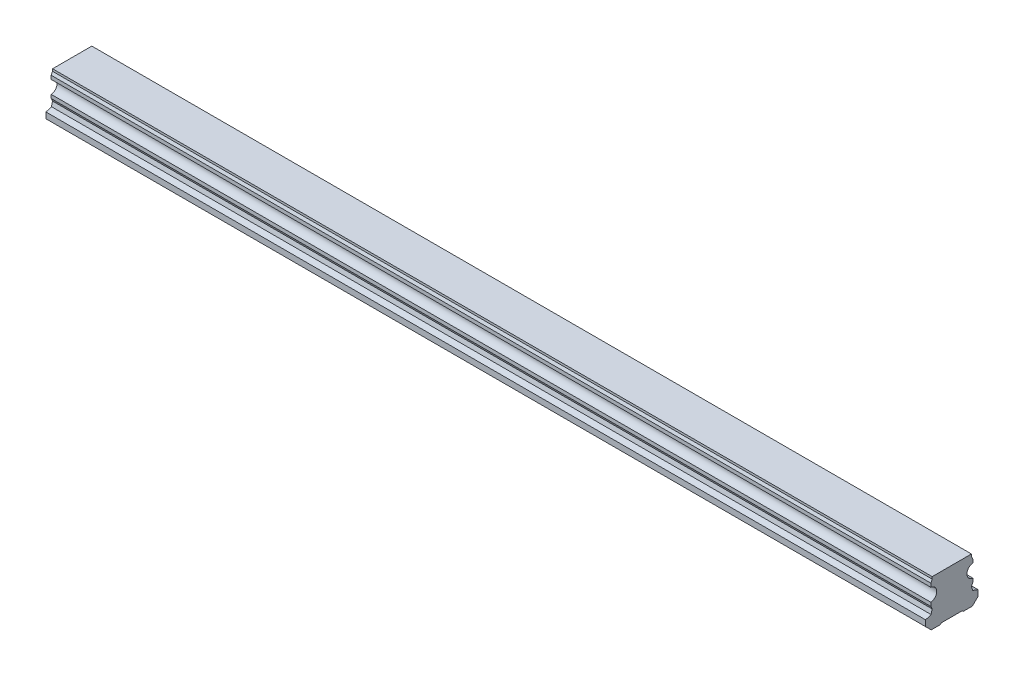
ISO-10303-21;
HEADER;
FILE_DESCRIPTION(('STEP AP214'),'2;1');
FILE_NAME('part.step','',(''),(''),'','','');
FILE_SCHEMA(('AUTOMOTIVE_DESIGN { 1 0 10303 214 1 1 1 1 }'));
ENDSEC;
DATA;
#1=APPLICATION_CONTEXT('core data for automotive mechanical design processes');
#2=APPLICATION_PROTOCOL_DEFINITION('international standard','automotive_design',2000,#1);
#3=PRODUCT_CONTEXT('',#1,'mechanical');
#4=PRODUCT('Part','Part','',(#3));
#5=PRODUCT_RELATED_PRODUCT_CATEGORY('part','',(#4));
#6=PRODUCT_DEFINITION_FORMATION('','',#4);
#7=PRODUCT_DEFINITION_CONTEXT('part definition',#1,'design');
#8=PRODUCT_DEFINITION('design','',#6,#7);
#9=PRODUCT_DEFINITION_SHAPE('','',#8);
#10=(LENGTH_UNIT() NAMED_UNIT(*) SI_UNIT(.MILLI.,.METRE.));
#11=(NAMED_UNIT(*) PLANE_ANGLE_UNIT() SI_UNIT($,.RADIAN.));
#12=(NAMED_UNIT(*) SI_UNIT($,.STERADIAN.) SOLID_ANGLE_UNIT());
#13=UNCERTAINTY_MEASURE_WITH_UNIT(LENGTH_MEASURE(1.E-05),#10,'distance_accuracy_value','');
#14=(GEOMETRIC_REPRESENTATION_CONTEXT(3) GLOBAL_UNCERTAINTY_ASSIGNED_CONTEXT((#13)) GLOBAL_UNIT_ASSIGNED_CONTEXT((#10,
#11,#12)) REPRESENTATION_CONTEXT('',''));
#15=CARTESIAN_POINT('',(0.,0.,0.));
#16=DIRECTION('',(0.,0.,1.));
#17=DIRECTION('',(1.,0.,0.));
#18=AXIS2_PLACEMENT_3D('',#15,#16,#17);
#19=CARTESIAN_POINT('',(390.,0.499999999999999,0.));
#20=DIRECTION('',(0.,-1.,0.));
#21=DIRECTION('',(0.,0.,-1.));
#22=AXIS2_PLACEMENT_3D('',#19,#20,#21);
#23=CONICAL_SURFACE('',#22,3.5,0.785398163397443);
#24=CARTESIAN_POINT('',(390.,1.00000000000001,0.));
#25=DIRECTION('',(0.,1.,0.));
#26=DIRECTION('',(0.,0.,1.));
#27=AXIS2_PLACEMENT_3D('',#24,#25,#26);
#28=CIRCLE('',#27,3.);
#29=CARTESIAN_POINT('',(390.,1.00000000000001,3.));
#30=VERTEX_POINT('',#29);
#31=EDGE_CURVE('E11',#30,#30,#28,.F.);
#32=ORIENTED_EDGE('',*,*,#31,.F.);
#33=EDGE_LOOP('',(#32));
#34=FACE_BOUND('',#33,.T.);
#35=CARTESIAN_POINT('',(390.,0.499999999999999,0.));
#36=DIRECTION('',(0.,1.,0.));
#37=DIRECTION('',(0.,0.,1.));
#38=AXIS2_PLACEMENT_3D('',#35,#36,#37);
#39=CIRCLE('',#38,3.5);
#40=CARTESIAN_POINT('',(390.,0.5,3.5));
#41=VERTEX_POINT('',#40);
#42=EDGE_CURVE('E482',#41,#41,#39,.T.);
#43=ORIENTED_EDGE('',*,*,#42,.F.);
#44=EDGE_LOOP('',(#43));
#45=FACE_BOUND('',#44,.T.);
#46=ADVANCED_FACE('F39',(#34,#45),#23,.F.);
#47=CARTESIAN_POINT('',(390.,12.,0.));
#48=DIRECTION('',(0.,-1.,0.));
#49=DIRECTION('',(0.,0.,-1.));
#50=AXIS2_PLACEMENT_3D('',#47,#48,#49);
#51=CYLINDRICAL_SURFACE('',#50,3.);
#52=ORIENTED_EDGE('',*,*,#31,.T.);
#53=EDGE_LOOP('',(#52));
#54=FACE_BOUND('',#53,.T.);
#55=CARTESIAN_POINT('',(390.,12.,0.));
#56=DIRECTION('',(0.,-1.,0.));
#57=DIRECTION('',(0.,0.,-1.));
#58=AXIS2_PLACEMENT_3D('',#55,#56,#57);
#59=CIRCLE('',#58,3.);
#60=CARTESIAN_POINT('',(390.,12.,-3.));
#61=VERTEX_POINT('',#60);
#62=EDGE_CURVE('E49',#61,#61,#59,.T.);
#63=ORIENTED_EDGE('',*,*,#62,.F.);
#64=EDGE_LOOP('',(#63));
#65=FACE_BOUND('',#64,.T.);
#66=ADVANCED_FACE('F646',(#54,#65),#51,.F.);
#67=CARTESIAN_POINT('',(390.,12.,0.));
#68=DIRECTION('',(0.,-1.,0.));
#69=DIRECTION('',(0.,0.,-1.));
#70=AXIS2_PLACEMENT_3D('',#67,#68,#69);
#71=PLANE('',#70);
#72=CARTESIAN_POINT('',(390.,12.,0.));
#73=DIRECTION('',(0.,-1.,0.));
#74=DIRECTION('',(0.,0.,-1.));
#75=AXIS2_PLACEMENT_3D('',#72,#73,#74);
#76=CIRCLE('',#75,2.5);
#77=CARTESIAN_POINT('',(390.,12.,-2.5));
#78=VERTEX_POINT('',#77);
#79=EDGE_CURVE('E42',#78,#78,#76,.T.);
#80=ORIENTED_EDGE('',*,*,#79,.F.);
#81=EDGE_LOOP('',(#80));
#82=FACE_BOUND('',#81,.T.);
#83=ORIENTED_EDGE('',*,*,#62,.T.);
#84=EDGE_LOOP('',(#83));
#85=FACE_BOUND('',#84,.T.);
#86=ADVANCED_FACE('F651',(#82,#85),#71,.T.);
#87=CARTESIAN_POINT('',(330.,0.499999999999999,0.));
#88=DIRECTION('',(0.,-1.,0.));
#89=DIRECTION('',(0.,0.,-1.));
#90=AXIS2_PLACEMENT_3D('',#87,#88,#89);
#91=CONICAL_SURFACE('',#90,3.5,0.785398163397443);
#92=CARTESIAN_POINT('',(330.,1.00000000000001,0.));
#93=DIRECTION('',(0.,1.,0.));
#94=DIRECTION('',(0.,0.,1.));
#95=AXIS2_PLACEMENT_3D('',#92,#93,#94);
#96=CIRCLE('',#95,3.);
#97=CARTESIAN_POINT('',(330.,1.00000000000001,3.));
#98=VERTEX_POINT('',#97);
#99=EDGE_CURVE('E478',#98,#98,#96,.F.);
#100=ORIENTED_EDGE('',*,*,#99,.F.);
#101=EDGE_LOOP('',(#100));
#102=FACE_BOUND('',#101,.T.);
#103=CARTESIAN_POINT('',(330.,0.499999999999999,0.));
#104=DIRECTION('',(0.,1.,0.));
#105=DIRECTION('',(0.,0.,1.));
#106=AXIS2_PLACEMENT_3D('',#103,#104,#105);
#107=CIRCLE('',#106,3.5);
#108=CARTESIAN_POINT('',(330.,0.5,3.5));
#109=VERTEX_POINT('',#108);
#110=EDGE_CURVE('E470',#109,#109,#107,.T.);
#111=ORIENTED_EDGE('',*,*,#110,.F.);
#112=EDGE_LOOP('',(#111));
#113=FACE_BOUND('',#112,.T.);
#114=ADVANCED_FACE('F774',(#102,#113),#91,.F.);
#115=CARTESIAN_POINT('',(330.,12.,0.));
#116=DIRECTION('',(0.,-1.,0.));
#117=DIRECTION('',(0.,0.,-1.));
#118=AXIS2_PLACEMENT_3D('',#115,#116,#117);
#119=CYLINDRICAL_SURFACE('',#118,3.);
#120=ORIENTED_EDGE('',*,*,#99,.T.);
#121=EDGE_LOOP('',(#120));
#122=FACE_BOUND('',#121,.T.);
#123=CARTESIAN_POINT('',(330.,12.,0.));
#124=DIRECTION('',(0.,-1.,0.));
#125=DIRECTION('',(0.,0.,-1.));
#126=AXIS2_PLACEMENT_3D('',#123,#124,#125);
#127=CIRCLE('',#126,3.);
#128=CARTESIAN_POINT('',(330.,12.,-3.));
#129=VERTEX_POINT('',#128);
#130=EDGE_CURVE('E474',#129,#129,#127,.T.);
#131=ORIENTED_EDGE('',*,*,#130,.F.);
#132=EDGE_LOOP('',(#131));
#133=FACE_BOUND('',#132,.T.);
#134=ADVANCED_FACE('F770',(#122,#133),#119,.F.);
#135=CARTESIAN_POINT('',(330.,12.,0.));
#136=DIRECTION('',(0.,-1.,0.));
#137=DIRECTION('',(0.,0.,-1.));
#138=AXIS2_PLACEMENT_3D('',#135,#136,#137);
#139=PLANE('',#138);
#140=CARTESIAN_POINT('',(330.,12.,0.));
#141=DIRECTION('',(0.,-1.,0.));
#142=DIRECTION('',(0.,0.,-1.));
#143=AXIS2_PLACEMENT_3D('',#140,#141,#142);
#144=CIRCLE('',#143,2.5);
#145=CARTESIAN_POINT('',(330.,12.,-2.5));
#146=VERTEX_POINT('',#145);
#147=EDGE_CURVE('E505',#146,#146,#144,.T.);
#148=ORIENTED_EDGE('',*,*,#147,.F.);
#149=EDGE_LOOP('',(#148));
#150=FACE_BOUND('',#149,.T.);
#151=ORIENTED_EDGE('',*,*,#130,.T.);
#152=EDGE_LOOP('',(#151));
#153=FACE_BOUND('',#152,.T.);
#154=ADVANCED_FACE('F766',(#150,#153),#139,.T.);
#155=CARTESIAN_POINT('',(270.,0.499999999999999,0.));
#156=DIRECTION('',(0.,-1.,0.));
#157=DIRECTION('',(0.,0.,-1.));
#158=AXIS2_PLACEMENT_3D('',#155,#156,#157);
#159=CONICAL_SURFACE('',#158,3.5,0.785398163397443);
#160=CARTESIAN_POINT('',(270.,1.00000000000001,0.));
#161=DIRECTION('',(0.,1.,0.));
#162=DIRECTION('',(0.,0.,1.));
#163=AXIS2_PLACEMENT_3D('',#160,#161,#162);
#164=CIRCLE('',#163,3.);
#165=CARTESIAN_POINT('',(270.,1.00000000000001,3.));
#166=VERTEX_POINT('',#165);
#167=EDGE_CURVE('E466',#166,#166,#164,.F.);
#168=ORIENTED_EDGE('',*,*,#167,.F.);
#169=EDGE_LOOP('',(#168));
#170=FACE_BOUND('',#169,.T.);
#171=CARTESIAN_POINT('',(270.,0.499999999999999,0.));
#172=DIRECTION('',(0.,1.,0.));
#173=DIRECTION('',(0.,0.,1.));
#174=AXIS2_PLACEMENT_3D('',#171,#172,#173);
#175=CIRCLE('',#174,3.5);
#176=CARTESIAN_POINT('',(270.,0.5,3.5));
#177=VERTEX_POINT('',#176);
#178=EDGE_CURVE('E458',#177,#177,#175,.T.);
#179=ORIENTED_EDGE('',*,*,#178,.F.);
#180=EDGE_LOOP('',(#179));
#181=FACE_BOUND('',#180,.T.);
#182=ADVANCED_FACE('F762',(#170,#181),#159,.F.);
#183=CARTESIAN_POINT('',(270.,12.,0.));
#184=DIRECTION('',(0.,-1.,0.));
#185=DIRECTION('',(0.,0.,-1.));
#186=AXIS2_PLACEMENT_3D('',#183,#184,#185);
#187=CYLINDRICAL_SURFACE('',#186,3.);
#188=ORIENTED_EDGE('',*,*,#167,.T.);
#189=EDGE_LOOP('',(#188));
#190=FACE_BOUND('',#189,.T.);
#191=CARTESIAN_POINT('',(270.,12.,0.));
#192=DIRECTION('',(0.,-1.,0.));
#193=DIRECTION('',(0.,0.,-1.));
#194=AXIS2_PLACEMENT_3D('',#191,#192,#193);
#195=CIRCLE('',#194,3.);
#196=CARTESIAN_POINT('',(270.,12.,-3.));
#197=VERTEX_POINT('',#196);
#198=EDGE_CURVE('E462',#197,#197,#195,.T.);
#199=ORIENTED_EDGE('',*,*,#198,.F.);
#200=EDGE_LOOP('',(#199));
#201=FACE_BOUND('',#200,.T.);
#202=ADVANCED_FACE('F758',(#190,#201),#187,.F.);
#203=CARTESIAN_POINT('',(270.,12.,0.));
#204=DIRECTION('',(0.,-1.,0.));
#205=DIRECTION('',(0.,0.,-1.));
#206=AXIS2_PLACEMENT_3D('',#203,#204,#205);
#207=PLANE('',#206);
#208=CARTESIAN_POINT('',(270.,12.,0.));
#209=DIRECTION('',(0.,-1.,0.));
#210=DIRECTION('',(0.,0.,-1.));
#211=AXIS2_PLACEMENT_3D('',#208,#209,#210);
#212=CIRCLE('',#211,2.5);
#213=CARTESIAN_POINT('',(270.,12.,-2.5));
#214=VERTEX_POINT('',#213);
#215=EDGE_CURVE('E502',#214,#214,#212,.T.);
#216=ORIENTED_EDGE('',*,*,#215,.F.);
#217=EDGE_LOOP('',(#216));
#218=FACE_BOUND('',#217,.T.);
#219=ORIENTED_EDGE('',*,*,#198,.T.);
#220=EDGE_LOOP('',(#219));
#221=FACE_BOUND('',#220,.T.);
#222=ADVANCED_FACE('F754',(#218,#221),#207,.T.);
#223=CARTESIAN_POINT('',(210.,0.499999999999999,0.));
#224=DIRECTION('',(0.,-1.,0.));
#225=DIRECTION('',(0.,0.,-1.));
#226=AXIS2_PLACEMENT_3D('',#223,#224,#225);
#227=CONICAL_SURFACE('',#226,3.5,0.785398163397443);
#228=CARTESIAN_POINT('',(210.,1.00000000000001,0.));
#229=DIRECTION('',(0.,1.,0.));
#230=DIRECTION('',(0.,0.,1.));
#231=AXIS2_PLACEMENT_3D('',#228,#229,#230);
#232=CIRCLE('',#231,3.);
#233=CARTESIAN_POINT('',(210.,1.00000000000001,3.));
#234=VERTEX_POINT('',#233);
#235=EDGE_CURVE('E454',#234,#234,#232,.F.);
#236=ORIENTED_EDGE('',*,*,#235,.F.);
#237=EDGE_LOOP('',(#236));
#238=FACE_BOUND('',#237,.T.);
#239=CARTESIAN_POINT('',(210.,0.499999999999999,0.));
#240=DIRECTION('',(0.,1.,0.));
#241=DIRECTION('',(0.,0.,1.));
#242=AXIS2_PLACEMENT_3D('',#239,#240,#241);
#243=CIRCLE('',#242,3.5);
#244=CARTESIAN_POINT('',(210.,0.5,3.5));
#245=VERTEX_POINT('',#244);
#246=EDGE_CURVE('E446',#245,#245,#243,.T.);
#247=ORIENTED_EDGE('',*,*,#246,.F.);
#248=EDGE_LOOP('',(#247));
#249=FACE_BOUND('',#248,.T.);
#250=ADVANCED_FACE('F750',(#238,#249),#227,.F.);
#251=CARTESIAN_POINT('',(210.,12.,0.));
#252=DIRECTION('',(0.,-1.,0.));
#253=DIRECTION('',(0.,0.,-1.));
#254=AXIS2_PLACEMENT_3D('',#251,#252,#253);
#255=CYLINDRICAL_SURFACE('',#254,3.);
#256=ORIENTED_EDGE('',*,*,#235,.T.);
#257=EDGE_LOOP('',(#256));
#258=FACE_BOUND('',#257,.T.);
#259=CARTESIAN_POINT('',(210.,12.,0.));
#260=DIRECTION('',(0.,-1.,0.));
#261=DIRECTION('',(0.,0.,-1.));
#262=AXIS2_PLACEMENT_3D('',#259,#260,#261);
#263=CIRCLE('',#262,3.);
#264=CARTESIAN_POINT('',(210.,12.,-3.));
#265=VERTEX_POINT('',#264);
#266=EDGE_CURVE('E450',#265,#265,#263,.T.);
#267=ORIENTED_EDGE('',*,*,#266,.F.);
#268=EDGE_LOOP('',(#267));
#269=FACE_BOUND('',#268,.T.);
#270=ADVANCED_FACE('F746',(#258,#269),#255,.F.);
#271=CARTESIAN_POINT('',(210.,12.,0.));
#272=DIRECTION('',(0.,-1.,0.));
#273=DIRECTION('',(0.,0.,-1.));
#274=AXIS2_PLACEMENT_3D('',#271,#272,#273);
#275=PLANE('',#274);
#276=CARTESIAN_POINT('',(210.,12.,0.));
#277=DIRECTION('',(0.,-1.,0.));
#278=DIRECTION('',(0.,0.,-1.));
#279=AXIS2_PLACEMENT_3D('',#276,#277,#278);
#280=CIRCLE('',#279,2.5);
#281=CARTESIAN_POINT('',(210.,12.,-2.5));
#282=VERTEX_POINT('',#281);
#283=EDGE_CURVE('E498',#282,#282,#280,.T.);
#284=ORIENTED_EDGE('',*,*,#283,.F.);
#285=EDGE_LOOP('',(#284));
#286=FACE_BOUND('',#285,.T.);
#287=ORIENTED_EDGE('',*,*,#266,.T.);
#288=EDGE_LOOP('',(#287));
#289=FACE_BOUND('',#288,.T.);
#290=ADVANCED_FACE('F742',(#286,#289),#275,.T.);
#291=CARTESIAN_POINT('',(150.,0.499999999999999,0.));
#292=DIRECTION('',(0.,-1.,0.));
#293=DIRECTION('',(0.,0.,-1.));
#294=AXIS2_PLACEMENT_3D('',#291,#292,#293);
#295=CONICAL_SURFACE('',#294,3.5,0.785398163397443);
#296=CARTESIAN_POINT('',(150.,1.00000000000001,0.));
#297=DIRECTION('',(0.,1.,0.));
#298=DIRECTION('',(0.,0.,1.));
#299=AXIS2_PLACEMENT_3D('',#296,#297,#298);
#300=CIRCLE('',#299,3.);
#301=CARTESIAN_POINT('',(150.,1.00000000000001,3.));
#302=VERTEX_POINT('',#301);
#303=EDGE_CURVE('E442',#302,#302,#300,.F.);
#304=ORIENTED_EDGE('',*,*,#303,.F.);
#305=EDGE_LOOP('',(#304));
#306=FACE_BOUND('',#305,.T.);
#307=CARTESIAN_POINT('',(150.,0.499999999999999,0.));
#308=DIRECTION('',(0.,1.,0.));
#309=DIRECTION('',(0.,0.,1.));
#310=AXIS2_PLACEMENT_3D('',#307,#308,#309);
#311=CIRCLE('',#310,3.5);
#312=CARTESIAN_POINT('',(150.,0.5,3.5));
#313=VERTEX_POINT('',#312);
#314=EDGE_CURVE('E434',#313,#313,#311,.T.);
#315=ORIENTED_EDGE('',*,*,#314,.F.);
#316=EDGE_LOOP('',(#315));
#317=FACE_BOUND('',#316,.T.);
#318=ADVANCED_FACE('F738',(#306,#317),#295,.F.);
#319=CARTESIAN_POINT('',(150.,12.,0.));
#320=DIRECTION('',(0.,-1.,0.));
#321=DIRECTION('',(0.,0.,-1.));
#322=AXIS2_PLACEMENT_3D('',#319,#320,#321);
#323=CYLINDRICAL_SURFACE('',#322,3.);
#324=ORIENTED_EDGE('',*,*,#303,.T.);
#325=EDGE_LOOP('',(#324));
#326=FACE_BOUND('',#325,.T.);
#327=CARTESIAN_POINT('',(150.,12.,0.));
#328=DIRECTION('',(0.,-1.,0.));
#329=DIRECTION('',(0.,0.,-1.));
#330=AXIS2_PLACEMENT_3D('',#327,#328,#329);
#331=CIRCLE('',#330,3.);
#332=CARTESIAN_POINT('',(150.,12.,-3.));
#333=VERTEX_POINT('',#332);
#334=EDGE_CURVE('E438',#333,#333,#331,.T.);
#335=ORIENTED_EDGE('',*,*,#334,.F.);
#336=EDGE_LOOP('',(#335));
#337=FACE_BOUND('',#336,.T.);
#338=ADVANCED_FACE('F734',(#326,#337),#323,.F.);
#339=CARTESIAN_POINT('',(150.,12.,0.));
#340=DIRECTION('',(0.,-1.,0.));
#341=DIRECTION('',(0.,0.,-1.));
#342=AXIS2_PLACEMENT_3D('',#339,#340,#341);
#343=PLANE('',#342);
#344=CARTESIAN_POINT('',(150.,12.,0.));
#345=DIRECTION('',(0.,-1.,0.));
#346=DIRECTION('',(0.,0.,-1.));
#347=AXIS2_PLACEMENT_3D('',#344,#345,#346);
#348=CIRCLE('',#347,2.5);
#349=CARTESIAN_POINT('',(150.,12.,-2.5));
#350=VERTEX_POINT('',#349);
#351=EDGE_CURVE('E493',#350,#350,#348,.T.);
#352=ORIENTED_EDGE('',*,*,#351,.F.);
#353=EDGE_LOOP('',(#352));
#354=FACE_BOUND('',#353,.T.);
#355=ORIENTED_EDGE('',*,*,#334,.T.);
#356=EDGE_LOOP('',(#355));
#357=FACE_BOUND('',#356,.T.);
#358=ADVANCED_FACE('F724',(#354,#357),#343,.T.);
#359=CARTESIAN_POINT('',(420.,21.8,-9.375));
#360=DIRECTION('',(0.,0.,1.));
#361=DIRECTION('',(0.,-1.,0.));
#362=AXIS2_PLACEMENT_3D('',#359,#360,#361);
#363=PLANE('',#362);
#364=DIRECTION('',(0.,1.,0.));
#365=VECTOR('',#364,1.);
#366=CARTESIAN_POINT('',(0.,21.8,-9.375));
#367=LINE('',#366,#365);
#368=CARTESIAN_POINT('',(0.,20.756,-9.375));
#369=VERTEX_POINT('',#368);
#370=CARTESIAN_POINT('',(0.,21.8,-9.375));
#371=VERTEX_POINT('',#370);
#372=EDGE_CURVE('E255',#369,#371,#367,.T.);
#373=ORIENTED_EDGE('',*,*,#372,.T.);
#374=DIRECTION('',(-1.,0.,0.));
#375=VECTOR('',#374,1.);
#376=CARTESIAN_POINT('',(420.,21.8,-9.375));
#377=LINE('',#376,#375);
#378=CARTESIAN_POINT('',(420.,21.8,-9.375));
#379=VERTEX_POINT('',#378);
#380=EDGE_CURVE('E423',#379,#371,#377,.T.);
#381=ORIENTED_EDGE('',*,*,#380,.F.);
#382=DIRECTION('',(0.,1.,0.));
#383=VECTOR('',#382,1.);
#384=CARTESIAN_POINT('',(420.,21.8,-9.375));
#385=LINE('',#384,#383);
#386=CARTESIAN_POINT('',(420.,20.756,-9.375));
#387=VERTEX_POINT('',#386);
#388=EDGE_CURVE('E332',#387,#379,#385,.T.);
#389=ORIENTED_EDGE('',*,*,#388,.F.);
#390=DIRECTION('',(-1.,0.,0.));
#391=VECTOR('',#390,1.);
#392=CARTESIAN_POINT('',(420.,20.756,-9.375));
#393=LINE('',#392,#391);
#394=EDGE_CURVE('E251',#387,#369,#393,.T.);
#395=ORIENTED_EDGE('',*,*,#394,.T.);
#396=EDGE_LOOP('',(#373,#381,#389,#395));
#397=FACE_BOUND('',#396,.T.);
#398=ADVANCED_FACE('F721',(#397),#363,.F.);
#399=CARTESIAN_POINT('',(420.,21.8,-9.375));
#400=DIRECTION('',(0.,-1.,0.));
#401=DIRECTION('',(0.,0.,-1.));
#402=AXIS2_PLACEMENT_3D('',#399,#400,#401);
#403=PLANE('',#402);
#404=DIRECTION('',(0.,0.,1.));
#405=VECTOR('',#404,1.);
#406=CARTESIAN_POINT('',(0.,21.8,-9.375));
#407=LINE('',#406,#405);
#408=CARTESIAN_POINT('',(0.,21.8,9.375));
#409=VERTEX_POINT('',#408);
#410=EDGE_CURVE('E259',#371,#409,#407,.T.);
#411=ORIENTED_EDGE('',*,*,#410,.T.);
#412=DIRECTION('',(-1.,0.,0.));
#413=VECTOR('',#412,1.);
#414=CARTESIAN_POINT('',(420.,21.8,9.375));
#415=LINE('',#414,#413);
#416=CARTESIAN_POINT('',(420.,21.8,9.375));
#417=VERTEX_POINT('',#416);
#418=EDGE_CURVE('E419',#417,#409,#415,.T.);
#419=ORIENTED_EDGE('',*,*,#418,.F.);
#420=DIRECTION('',(0.,0.,1.));
#421=VECTOR('',#420,1.);
#422=CARTESIAN_POINT('',(420.,21.8,-9.375));
#423=LINE('',#422,#421);
#424=EDGE_CURVE('E157',#379,#417,#423,.T.);
#425=ORIENTED_EDGE('',*,*,#424,.F.);
#426=ORIENTED_EDGE('',*,*,#380,.T.);
#427=EDGE_LOOP('',(#411,#419,#425,#426));
#428=FACE_BOUND('',#427,.T.);
#429=ADVANCED_FACE('F717',(#428),#403,.F.);
#430=CARTESIAN_POINT('',(420.,21.8,9.375));
#431=DIRECTION('',(0.,0.,-1.));
#432=DIRECTION('',(0.,1.,0.));
#433=AXIS2_PLACEMENT_3D('',#430,#431,#432);
#434=PLANE('',#433);
#435=DIRECTION('',(0.,-1.,0.));
#436=VECTOR('',#435,1.);
#437=CARTESIAN_POINT('',(0.,21.8,9.375));
#438=LINE('',#437,#436);
#439=CARTESIAN_POINT('',(0.,20.756,9.37499999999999));
#440=VERTEX_POINT('',#439);
#441=EDGE_CURVE('E263',#409,#440,#438,.T.);
#442=ORIENTED_EDGE('',*,*,#441,.T.);
#443=DIRECTION('',(-1.,0.,0.));
#444=VECTOR('',#443,1.);
#445=CARTESIAN_POINT('',(420.,20.756,9.37499999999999));
#446=LINE('',#445,#444);
#447=CARTESIAN_POINT('',(420.,20.756,9.37499999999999));
#448=VERTEX_POINT('',#447);
#449=EDGE_CURVE('E415',#448,#440,#446,.T.);
#450=ORIENTED_EDGE('',*,*,#449,.F.);
#451=DIRECTION('',(0.,-1.,0.));
#452=VECTOR('',#451,1.);
#453=CARTESIAN_POINT('',(420.,21.8,9.375));
#454=LINE('',#453,#452);
#455=EDGE_CURVE('E548',#417,#448,#454,.T.);
#456=ORIENTED_EDGE('',*,*,#455,.F.);
#457=ORIENTED_EDGE('',*,*,#418,.T.);
#458=EDGE_LOOP('',(#442,#450,#456,#457));
#459=FACE_BOUND('',#458,.T.);
#460=ADVANCED_FACE('F713',(#459),#434,.F.);
#461=CARTESIAN_POINT('',(420.,20.756,9.37499999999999));
#462=DIRECTION('',(0.,-0.422618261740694,-0.906307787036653));
#463=DIRECTION('',(0.,0.906307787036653,-0.422618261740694));
#464=AXIS2_PLACEMENT_3D('',#461,#462,#463);
#465=PLANE('',#464);
#466=DIRECTION('',(0.,-0.906307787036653,0.422618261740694));
#467=VECTOR('',#466,1.);
#468=CARTESIAN_POINT('',(0.,20.756,9.37499999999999));
#469=LINE('',#468,#467);
#470=CARTESIAN_POINT('',(0.,19.4156831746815,10.));
#471=VERTEX_POINT('',#470);
#472=EDGE_CURVE('E266',#440,#471,#469,.T.);
#473=ORIENTED_EDGE('',*,*,#472,.T.);
#474=DIRECTION('',(-1.,0.,0.));
#475=VECTOR('',#474,1.);
#476=CARTESIAN_POINT('',(420.,19.4156831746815,10.));
#477=LINE('',#476,#475);
#478=CARTESIAN_POINT('',(420.,19.4156831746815,10.));
#479=VERTEX_POINT('',#478);
#480=EDGE_CURVE('E411',#479,#471,#477,.T.);
#481=ORIENTED_EDGE('',*,*,#480,.F.);
#482=DIRECTION('',(0.,-0.906307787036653,0.422618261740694));
#483=VECTOR('',#482,1.);
#484=CARTESIAN_POINT('',(420.,20.756,9.37499999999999));
#485=LINE('',#484,#483);
#486=EDGE_CURVE('E550',#448,#479,#485,.T.);
#487=ORIENTED_EDGE('',*,*,#486,.F.);
#488=ORIENTED_EDGE('',*,*,#449,.T.);
#489=EDGE_LOOP('',(#473,#481,#487,#488));
#490=FACE_BOUND('',#489,.T.);
#491=ADVANCED_FACE('F709',(#490),#465,.F.);
#492=CARTESIAN_POINT('',(420.,19.4156831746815,10.));
#493=DIRECTION('',(0.,0.,-1.));
#494=DIRECTION('',(-1.,0.,0.));
#495=AXIS2_PLACEMENT_3D('',#492,#493,#494);
#496=PLANE('',#495);
#497=DIRECTION('',(0.,-1.,0.));
#498=VECTOR('',#497,1.);
#499=CARTESIAN_POINT('',(0.,19.4156831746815,10.));
#500=LINE('',#499,#498);
#501=CARTESIAN_POINT('',(0.,17.6854497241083,10.));
#502=VERTEX_POINT('',#501);
#503=EDGE_CURVE('E269',#471,#502,#500,.T.);
#504=ORIENTED_EDGE('',*,*,#503,.T.);
#505=DIRECTION('',(-1.,0.,0.));
#506=VECTOR('',#505,1.);
#507=CARTESIAN_POINT('',(420.,17.6854497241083,10.));
#508=LINE('',#507,#506);
#509=CARTESIAN_POINT('',(420.,17.6854497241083,10.));
#510=VERTEX_POINT('',#509);
#511=EDGE_CURVE('E407',#510,#502,#508,.T.);
#512=ORIENTED_EDGE('',*,*,#511,.F.);
#513=DIRECTION('',(0.,-1.,0.));
#514=VECTOR('',#513,1.);
#515=CARTESIAN_POINT('',(420.,19.4156831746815,10.));
#516=LINE('',#515,#514);
#517=EDGE_CURVE('E553',#479,#510,#516,.T.);
#518=ORIENTED_EDGE('',*,*,#517,.F.);
#519=ORIENTED_EDGE('',*,*,#480,.T.);
#520=EDGE_LOOP('',(#504,#512,#518,#519));
#521=FACE_BOUND('',#520,.T.);
#522=ADVANCED_FACE('F705',(#521),#496,.F.);
#523=CARTESIAN_POINT('',(420.,14.6,10.3));
#524=DIRECTION('',(-1.,0.,0.));
#525=DIRECTION('',(0.,0.,1.));
#526=AXIS2_PLACEMENT_3D('',#523,#524,#525);
#527=CYLINDRICAL_SURFACE('',#526,3.1);
#528=CARTESIAN_POINT('',(0.,14.6,10.3));
#529=DIRECTION('',(-1.,0.,0.));
#530=DIRECTION('',(0.,0.,-1.));
#531=AXIS2_PLACEMENT_3D('',#528,#529,#530);
#532=CIRCLE('',#531,3.1);
#533=CARTESIAN_POINT('',(0.,11.5145502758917,10.));
#534=VERTEX_POINT('',#533);
#535=EDGE_CURVE('E272',#502,#534,#532,.T.);
#536=ORIENTED_EDGE('',*,*,#535,.T.);
#537=DIRECTION('',(-1.,0.,0.));
#538=VECTOR('',#537,1.);
#539=CARTESIAN_POINT('',(420.,11.5145502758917,10.));
#540=LINE('',#539,#538);
#541=CARTESIAN_POINT('',(420.,11.5145502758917,10.));
#542=VERTEX_POINT('',#541);
#543=EDGE_CURVE('E403',#542,#534,#540,.T.);
#544=ORIENTED_EDGE('',*,*,#543,.F.);
#545=CARTESIAN_POINT('',(420.,14.6,10.3));
#546=DIRECTION('',(-1.,0.,0.));
#547=DIRECTION('',(0.,0.,-1.));
#548=AXIS2_PLACEMENT_3D('',#545,#546,#547);
#549=CIRCLE('',#548,3.1);
#550=EDGE_CURVE('E556',#510,#542,#549,.T.);
#551=ORIENTED_EDGE('',*,*,#550,.F.);
#552=ORIENTED_EDGE('',*,*,#511,.T.);
#553=EDGE_LOOP('',(#536,#544,#551,#552));
#554=FACE_BOUND('',#553,.T.);
#555=ADVANCED_FACE('F701',(#554),#527,.F.);
#556=CARTESIAN_POINT('',(420.,9.78431682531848,10.));
#557=DIRECTION('',(0.,0.,-1.));
#558=DIRECTION('',(0.,1.,0.));
#559=AXIS2_PLACEMENT_3D('',#556,#557,#558);
#560=PLANE('',#559);
#561=DIRECTION('',(0.,-1.,0.));
#562=VECTOR('',#561,1.);
#563=CARTESIAN_POINT('',(0.,9.78431682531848,10.));
#564=LINE('',#563,#562);
#565=CARTESIAN_POINT('',(0.,9.78431682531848,10.));
#566=VERTEX_POINT('',#565);
#567=EDGE_CURVE('E275',#534,#566,#564,.T.);
#568=ORIENTED_EDGE('',*,*,#567,.T.);
#569=DIRECTION('',(-1.,0.,0.));
#570=VECTOR('',#569,1.);
#571=CARTESIAN_POINT('',(420.,9.78431682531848,10.));
#572=LINE('',#571,#570);
#573=CARTESIAN_POINT('',(420.,9.78431682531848,10.));
#574=VERTEX_POINT('',#573);
#575=EDGE_CURVE('E399',#574,#566,#572,.T.);
#576=ORIENTED_EDGE('',*,*,#575,.F.);
#577=DIRECTION('',(0.,-1.,0.));
#578=VECTOR('',#577,1.);
#579=CARTESIAN_POINT('',(420.,9.78431682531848,10.));
#580=LINE('',#579,#578);
#581=EDGE_CURVE('E559',#542,#574,#580,.T.);
#582=ORIENTED_EDGE('',*,*,#581,.F.);
#583=ORIENTED_EDGE('',*,*,#543,.T.);
#584=EDGE_LOOP('',(#568,#576,#582,#583));
#585=FACE_BOUND('',#584,.T.);
#586=ADVANCED_FACE('F697',(#585),#560,.F.);
#587=CARTESIAN_POINT('',(420.,8.44400000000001,9.375));
#588=DIRECTION('',(0.,0.4226182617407,-0.90630778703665));
#589=DIRECTION('',(0.,0.90630778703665,0.4226182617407));
#590=AXIS2_PLACEMENT_3D('',#587,#588,#589);
#591=PLANE('',#590);
#592=DIRECTION('',(0.,-0.90630778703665,-0.4226182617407));
#593=VECTOR('',#592,1.);
#594=CARTESIAN_POINT('',(0.,8.44400000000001,9.375));
#595=LINE('',#594,#593);
#596=CARTESIAN_POINT('',(0.,8.44400000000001,9.375));
#597=VERTEX_POINT('',#596);
#598=EDGE_CURVE('E278',#566,#597,#595,.T.);
#599=ORIENTED_EDGE('',*,*,#598,.T.);
#600=DIRECTION('',(-1.,0.,0.));
#601=VECTOR('',#600,1.);
#602=CARTESIAN_POINT('',(420.,8.44400000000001,9.375));
#603=LINE('',#602,#601);
#604=CARTESIAN_POINT('',(420.,8.44400000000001,9.375));
#605=VERTEX_POINT('',#604);
#606=EDGE_CURVE('E395',#605,#597,#603,.T.);
#607=ORIENTED_EDGE('',*,*,#606,.F.);
#608=DIRECTION('',(0.,-0.90630778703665,-0.4226182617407));
#609=VECTOR('',#608,1.);
#610=CARTESIAN_POINT('',(420.,8.44400000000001,9.375));
#611=LINE('',#610,#609);
#612=EDGE_CURVE('E562',#574,#605,#611,.T.);
#613=ORIENTED_EDGE('',*,*,#612,.F.);
#614=ORIENTED_EDGE('',*,*,#575,.T.);
#615=EDGE_LOOP('',(#599,#607,#613,#614));
#616=FACE_BOUND('',#615,.T.);
#617=ADVANCED_FACE('F693',(#616),#591,.F.);
#618=CARTESIAN_POINT('',(420.,6.4,9.92268814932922));
#619=DIRECTION('',(0.,-0.258819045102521,-0.965925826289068));
#620=DIRECTION('',(0.,0.965925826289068,-0.258819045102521));
#621=AXIS2_PLACEMENT_3D('',#618,#619,#620);
#622=PLANE('',#621);
#623=DIRECTION('',(0.,-0.965925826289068,0.258819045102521));
#624=VECTOR('',#623,1.);
#625=CARTESIAN_POINT('',(0.,6.4,9.92268814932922));
#626=LINE('',#625,#624);
#627=CARTESIAN_POINT('',(0.,6.4,9.92268814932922));
#628=VERTEX_POINT('',#627);
#629=EDGE_CURVE('E281',#597,#628,#626,.T.);
#630=ORIENTED_EDGE('',*,*,#629,.T.);
#631=DIRECTION('',(-1.,0.,0.));
#632=VECTOR('',#631,1.);
#633=CARTESIAN_POINT('',(420.,6.4,9.92268814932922));
#634=LINE('',#633,#632);
#635=CARTESIAN_POINT('',(420.,6.4,9.92268814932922));
#636=VERTEX_POINT('',#635);
#637=EDGE_CURVE('E391',#636,#628,#634,.T.);
#638=ORIENTED_EDGE('',*,*,#637,.F.);
#639=DIRECTION('',(0.,-0.965925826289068,0.258819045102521));
#640=VECTOR('',#639,1.);
#641=CARTESIAN_POINT('',(420.,6.4,9.92268814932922));
#642=LINE('',#641,#640);
#643=EDGE_CURVE('E565',#605,#636,#642,.T.);
#644=ORIENTED_EDGE('',*,*,#643,.F.);
#645=ORIENTED_EDGE('',*,*,#606,.T.);
#646=EDGE_LOOP('',(#630,#638,#644,#645));
#647=FACE_BOUND('',#646,.T.);
#648=ADVANCED_FACE('F689',(#647),#622,.F.);
#649=CARTESIAN_POINT('',(420.,5.48933857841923,12.5));
#650=DIRECTION('',(0.,-0.942872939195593,-0.333152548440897));
#651=DIRECTION('',(0.,0.333152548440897,-0.942872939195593));
#652=AXIS2_PLACEMENT_3D('',#649,#650,#651);
#653=PLANE('',#652);
#654=DIRECTION('',(0.,-0.333152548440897,0.942872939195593));
#655=VECTOR('',#654,1.);
#656=CARTESIAN_POINT('',(0.,5.48933857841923,12.5));
#657=LINE('',#656,#655);
#658=CARTESIAN_POINT('',(0.,5.48933857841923,12.5));
#659=VERTEX_POINT('',#658);
#660=EDGE_CURVE('E284',#628,#659,#657,.T.);
#661=ORIENTED_EDGE('',*,*,#660,.T.);
#662=DIRECTION('',(-1.,0.,0.));
#663=VECTOR('',#662,1.);
#664=CARTESIAN_POINT('',(420.,5.48933857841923,12.5));
#665=LINE('',#664,#663);
#666=CARTESIAN_POINT('',(420.,5.48933857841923,12.5));
#667=VERTEX_POINT('',#666);
#668=EDGE_CURVE('E387',#667,#659,#665,.T.);
#669=ORIENTED_EDGE('',*,*,#668,.F.);
#670=DIRECTION('',(0.,-0.333152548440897,0.942872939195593));
#671=VECTOR('',#670,1.);
#672=CARTESIAN_POINT('',(420.,5.48933857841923,12.5));
#673=LINE('',#672,#671);
#674=EDGE_CURVE('E568',#636,#667,#673,.T.);
#675=ORIENTED_EDGE('',*,*,#674,.F.);
#676=ORIENTED_EDGE('',*,*,#637,.T.);
#677=EDGE_LOOP('',(#661,#669,#675,#676));
#678=FACE_BOUND('',#677,.T.);
#679=ADVANCED_FACE('F685',(#678),#653,.F.);
#680=CARTESIAN_POINT('',(420.,2.65,12.5));
#681=DIRECTION('',(0.,0.,-1.));
#682=DIRECTION('',(0.,1.,0.));
#683=AXIS2_PLACEMENT_3D('',#680,#681,#682);
#684=PLANE('',#683);
#685=DIRECTION('',(0.,-1.,0.));
#686=VECTOR('',#685,1.);
#687=CARTESIAN_POINT('',(0.,2.65,12.5));
#688=LINE('',#687,#686);
#689=CARTESIAN_POINT('',(0.,2.65,12.5));
#690=VERTEX_POINT('',#689);
#691=EDGE_CURVE('E287',#659,#690,#688,.T.);
#692=ORIENTED_EDGE('',*,*,#691,.T.);
#693=DIRECTION('',(-1.,0.,0.));
#694=VECTOR('',#693,1.);
#695=CARTESIAN_POINT('',(420.,2.65,12.5));
#696=LINE('',#695,#694);
#697=CARTESIAN_POINT('',(420.,2.65,12.5));
#698=VERTEX_POINT('',#697);
#699=EDGE_CURVE('E383',#698,#690,#696,.T.);
#700=ORIENTED_EDGE('',*,*,#699,.F.);
#701=DIRECTION('',(0.,-1.,0.));
#702=VECTOR('',#701,1.);
#703=CARTESIAN_POINT('',(420.,2.65,12.5));
#704=LINE('',#703,#702);
#705=EDGE_CURVE('E571',#667,#698,#704,.T.);
#706=ORIENTED_EDGE('',*,*,#705,.F.);
#707=ORIENTED_EDGE('',*,*,#668,.T.);
#708=EDGE_LOOP('',(#692,#700,#706,#707));
#709=FACE_BOUND('',#708,.T.);
#710=ADVANCED_FACE('F681',(#709),#684,.F.);
#711=CARTESIAN_POINT('',(420.,0.,9.85));
#712=DIRECTION('',(0.,0.707106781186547,-0.707106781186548));
#713=DIRECTION('',(0.,0.707106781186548,0.707106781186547));
#714=AXIS2_PLACEMENT_3D('',#711,#712,#713);
#715=PLANE('',#714);
#716=DIRECTION('',(0.,-0.707106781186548,-0.707106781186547));
#717=VECTOR('',#716,1.);
#718=CARTESIAN_POINT('',(0.,0.,9.85));
#719=LINE('',#718,#717);
#720=CARTESIAN_POINT('',(0.,0.,9.85));
#721=VERTEX_POINT('',#720);
#722=EDGE_CURVE('E290',#690,#721,#719,.T.);
#723=ORIENTED_EDGE('',*,*,#722,.T.);
#724=DIRECTION('',(-1.,0.,0.));
#725=VECTOR('',#724,1.);
#726=CARTESIAN_POINT('',(420.,0.,9.85));
#727=LINE('',#726,#725);
#728=CARTESIAN_POINT('',(420.,0.,9.85));
#729=VERTEX_POINT('',#728);
#730=EDGE_CURVE('E379',#729,#721,#727,.T.);
#731=ORIENTED_EDGE('',*,*,#730,.F.);
#732=DIRECTION('',(0.,-0.707106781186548,-0.707106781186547));
#733=VECTOR('',#732,1.);
#734=CARTESIAN_POINT('',(420.,0.,9.85));
#735=LINE('',#734,#733);
#736=EDGE_CURVE('E574',#698,#729,#735,.T.);
#737=ORIENTED_EDGE('',*,*,#736,.F.);
#738=ORIENTED_EDGE('',*,*,#699,.T.);
#739=EDGE_LOOP('',(#723,#731,#737,#738));
#740=FACE_BOUND('',#739,.T.);
#741=ADVANCED_FACE('F677',(#740),#715,.F.);
#742=CARTESIAN_POINT('',(420.,0.,5.5));
#743=DIRECTION('',(0.,1.,0.));
#744=DIRECTION('',(0.,0.,1.));
#745=AXIS2_PLACEMENT_3D('',#742,#743,#744);
#746=PLANE('',#745);
#747=DIRECTION('',(0.,0.,-1.));
#748=VECTOR('',#747,1.);
#749=CARTESIAN_POINT('',(0.,0.,5.5));
#750=LINE('',#749,#748);
#751=CARTESIAN_POINT('',(0.,0.,5.5));
#752=VERTEX_POINT('',#751);
#753=EDGE_CURVE('E293',#721,#752,#750,.T.);
#754=ORIENTED_EDGE('',*,*,#753,.T.);
#755=DIRECTION('',(-1.,0.,0.));
#756=VECTOR('',#755,1.);
#757=CARTESIAN_POINT('',(420.,0.,5.5));
#758=LINE('',#757,#756);
#759=CARTESIAN_POINT('',(420.,0.,5.5));
#760=VERTEX_POINT('',#759);
#761=EDGE_CURVE('E375',#760,#752,#758,.T.);
#762=ORIENTED_EDGE('',*,*,#761,.F.);
#763=DIRECTION('',(0.,0.,-1.));
#764=VECTOR('',#763,1.);
#765=CARTESIAN_POINT('',(420.,0.,5.5));
#766=LINE('',#765,#764);
#767=EDGE_CURVE('E577',#729,#760,#766,.T.);
#768=ORIENTED_EDGE('',*,*,#767,.F.);
#769=ORIENTED_EDGE('',*,*,#730,.T.);
#770=EDGE_LOOP('',(#754,#762,#768,#769));
#771=FACE_BOUND('',#770,.T.);
#772=ADVANCED_FACE('F669',(#771),#746,.F.);
#773=CARTESIAN_POINT('',(420.,0.5,5.));
#774=DIRECTION('',(0.,0.707106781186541,0.707106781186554));
#775=DIRECTION('',(0.,-0.707106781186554,0.707106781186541));
#776=AXIS2_PLACEMENT_3D('',#773,#774,#775);
#777=PLANE('',#776);
#778=DIRECTION('',(0.,0.707106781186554,-0.707106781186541));
#779=VECTOR('',#778,1.);
#780=CARTESIAN_POINT('',(0.,0.5,5.));
#781=LINE('',#780,#779);
#782=CARTESIAN_POINT('',(0.,0.5,5.));
#783=VERTEX_POINT('',#782);
#784=EDGE_CURVE('E296',#752,#783,#781,.T.);
#785=ORIENTED_EDGE('',*,*,#784,.T.);
#786=DIRECTION('',(-1.,0.,0.));
#787=VECTOR('',#786,1.);
#788=CARTESIAN_POINT('',(420.,0.5,5.));
#789=LINE('',#788,#787);
#790=CARTESIAN_POINT('',(420.,0.5,5.));
#791=VERTEX_POINT('',#790);
#792=EDGE_CURVE('E371',#791,#783,#789,.T.);
#793=ORIENTED_EDGE('',*,*,#792,.F.);
#794=DIRECTION('',(0.,0.707106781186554,-0.707106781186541));
#795=VECTOR('',#794,1.);
#796=CARTESIAN_POINT('',(420.,0.5,5.));
#797=LINE('',#796,#795);
#798=EDGE_CURVE('E580',#760,#791,#797,.T.);
#799=ORIENTED_EDGE('',*,*,#798,.F.);
#800=ORIENTED_EDGE('',*,*,#761,.T.);
#801=EDGE_LOOP('',(#785,#793,#799,#800));
#802=FACE_BOUND('',#801,.T.);
#803=ADVANCED_FACE('F660',(#802),#777,.F.);
#804=CARTESIAN_POINT('',(420.,0.499999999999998,-5.));
#805=DIRECTION('',(0.,1.,0.));
#806=DIRECTION('',(0.,0.,1.));
#807=AXIS2_PLACEMENT_3D('',#804,#805,#806);
#808=PLANE('',#807);
#809=CARTESIAN_POINT('',(90.,0.499999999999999,0.));
#810=DIRECTION('',(0.,1.,0.));
#811=DIRECTION('',(0.,0.,1.));
#812=AXIS2_PLACEMENT_3D('',#809,#810,#811);
#813=CIRCLE('',#812,3.5);
#814=CARTESIAN_POINT('',(90.,0.5,3.5));
#815=VERTEX_POINT('',#814);
#816=EDGE_CURVE('E512',#815,#815,#813,.T.);
#817=ORIENTED_EDGE('',*,*,#816,.T.);
#818=EDGE_LOOP('',(#817));
#819=FACE_BOUND('',#818,.T.);
#820=CARTESIAN_POINT('',(30.,0.499999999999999,0.));
#821=DIRECTION('',(0.,1.,0.));
#822=DIRECTION('',(0.,0.,1.));
#823=AXIS2_PLACEMENT_3D('',#820,#821,#822);
#824=CIRCLE('',#823,3.5);
#825=CARTESIAN_POINT('',(30.,0.5,3.5));
#826=VERTEX_POINT('',#825);
#827=EDGE_CURVE('E426',#826,#826,#824,.T.);
#828=ORIENTED_EDGE('',*,*,#827,.T.);
#829=EDGE_LOOP('',(#828));
#830=FACE_BOUND('',#829,.T.);
#831=DIRECTION('',(0.,0.,-1.));
#832=VECTOR('',#831,1.);
#833=CARTESIAN_POINT('',(0.,0.499999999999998,-5.));
#834=LINE('',#833,#832);
#835=CARTESIAN_POINT('',(0.,0.499999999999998,-5.));
#836=VERTEX_POINT('',#835);
#837=EDGE_CURVE('E299',#783,#836,#834,.T.);
#838=ORIENTED_EDGE('',*,*,#837,.T.);
#839=DIRECTION('',(-1.,0.,0.));
#840=VECTOR('',#839,1.);
#841=CARTESIAN_POINT('',(420.,0.499999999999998,-5.));
#842=LINE('',#841,#840);
#843=CARTESIAN_POINT('',(420.,0.499999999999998,-5.));
#844=VERTEX_POINT('',#843);
#845=EDGE_CURVE('E367',#844,#836,#842,.T.);
#846=ORIENTED_EDGE('',*,*,#845,.F.);
#847=DIRECTION('',(0.,0.,-1.));
#848=VECTOR('',#847,1.);
#849=CARTESIAN_POINT('',(420.,0.499999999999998,-5.));
#850=LINE('',#849,#848);
#851=EDGE_CURVE('E583',#791,#844,#850,.T.);
#852=ORIENTED_EDGE('',*,*,#851,.F.);
#853=ORIENTED_EDGE('',*,*,#792,.T.);
#854=EDGE_LOOP('',(#838,#846,#852,#853));
#855=FACE_BOUND('',#854,.T.);
#856=ORIENTED_EDGE('',*,*,#314,.T.);
#857=EDGE_LOOP('',(#856));
#858=FACE_BOUND('',#857,.T.);
#859=ORIENTED_EDGE('',*,*,#246,.T.);
#860=EDGE_LOOP('',(#859));
#861=FACE_BOUND('',#860,.T.);
#862=ORIENTED_EDGE('',*,*,#178,.T.);
#863=EDGE_LOOP('',(#862));
#864=FACE_BOUND('',#863,.T.);
#865=ORIENTED_EDGE('',*,*,#110,.T.);
#866=EDGE_LOOP('',(#865));
#867=FACE_BOUND('',#866,.T.);
#868=ORIENTED_EDGE('',*,*,#42,.T.);
#869=EDGE_LOOP('',(#868));
#870=FACE_BOUND('',#869,.T.);
#871=ADVANCED_FACE('F657',(#819,#830,#855,#858,#861,#864,#867,#870),#808,.F.);
#872=CARTESIAN_POINT('',(420.,0.,-5.5));
#873=DIRECTION('',(0.,0.707106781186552,-0.707106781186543));
#874=DIRECTION('',(0.,0.707106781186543,0.707106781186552));
#875=AXIS2_PLACEMENT_3D('',#872,#873,#874);
#876=PLANE('',#875);
#877=DIRECTION('',(0.,-0.707106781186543,-0.707106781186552));
#878=VECTOR('',#877,1.);
#879=CARTESIAN_POINT('',(0.,0.,-5.5));
#880=LINE('',#879,#878);
#881=CARTESIAN_POINT('',(0.,0.,-5.5));
#882=VERTEX_POINT('',#881);
#883=EDGE_CURVE('E302',#836,#882,#880,.T.);
#884=ORIENTED_EDGE('',*,*,#883,.T.);
#885=DIRECTION('',(-1.,0.,0.));
#886=VECTOR('',#885,1.);
#887=CARTESIAN_POINT('',(420.,0.,-5.5));
#888=LINE('',#887,#886);
#889=CARTESIAN_POINT('',(420.,0.,-5.5));
#890=VERTEX_POINT('',#889);
#891=EDGE_CURVE('E363',#890,#882,#888,.T.);
#892=ORIENTED_EDGE('',*,*,#891,.F.);
#893=DIRECTION('',(0.,-0.707106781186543,-0.707106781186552));
#894=VECTOR('',#893,1.);
#895=CARTESIAN_POINT('',(420.,0.,-5.5));
#896=LINE('',#895,#894);
#897=EDGE_CURVE('E586',#844,#890,#896,.T.);
#898=ORIENTED_EDGE('',*,*,#897,.F.);
#899=ORIENTED_EDGE('',*,*,#845,.T.);
#900=EDGE_LOOP('',(#884,#892,#898,#899));
#901=FACE_BOUND('',#900,.T.);
#902=ADVANCED_FACE('F659',(#901),#876,.F.);
#903=CARTESIAN_POINT('',(420.,0.,-9.85));
#904=DIRECTION('',(0.,1.,0.));
#905=DIRECTION('',(0.,0.,1.));
#906=AXIS2_PLACEMENT_3D('',#903,#904,#905);
#907=PLANE('',#906);
#908=DIRECTION('',(0.,0.,-1.));
#909=VECTOR('',#908,1.);
#910=CARTESIAN_POINT('',(0.,0.,-9.85));
#911=LINE('',#910,#909);
#912=CARTESIAN_POINT('',(0.,0.,-9.85));
#913=VERTEX_POINT('',#912);
#914=EDGE_CURVE('E305',#882,#913,#911,.T.);
#915=ORIENTED_EDGE('',*,*,#914,.T.);
#916=DIRECTION('',(-1.,0.,0.));
#917=VECTOR('',#916,1.);
#918=CARTESIAN_POINT('',(420.,0.,-9.85));
#919=LINE('',#918,#917);
#920=CARTESIAN_POINT('',(420.,0.,-9.85));
#921=VERTEX_POINT('',#920);
#922=EDGE_CURVE('E359',#921,#913,#919,.T.);
#923=ORIENTED_EDGE('',*,*,#922,.F.);
#924=DIRECTION('',(0.,0.,-1.));
#925=VECTOR('',#924,1.);
#926=CARTESIAN_POINT('',(420.,0.,-9.85));
#927=LINE('',#926,#925);
#928=EDGE_CURVE('E589',#890,#921,#927,.T.);
#929=ORIENTED_EDGE('',*,*,#928,.F.);
#930=ORIENTED_EDGE('',*,*,#891,.T.);
#931=EDGE_LOOP('',(#915,#923,#929,#930));
#932=FACE_BOUND('',#931,.T.);
#933=ADVANCED_FACE('F666',(#932),#907,.F.);
#934=CARTESIAN_POINT('',(420.,2.65,-12.5));
#935=DIRECTION('',(0.,0.707106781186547,0.707106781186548));
#936=DIRECTION('',(0.,-0.707106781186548,0.707106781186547));
#937=AXIS2_PLACEMENT_3D('',#934,#935,#936);
#938=PLANE('',#937);
#939=DIRECTION('',(0.,0.707106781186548,-0.707106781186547));
#940=VECTOR('',#939,1.);
#941=CARTESIAN_POINT('',(0.,2.65,-12.5));
#942=LINE('',#941,#940);
#943=CARTESIAN_POINT('',(0.,2.65,-12.5));
#944=VERTEX_POINT('',#943);
#945=EDGE_CURVE('E308',#913,#944,#942,.T.);
#946=ORIENTED_EDGE('',*,*,#945,.T.);
#947=DIRECTION('',(-1.,0.,0.));
#948=VECTOR('',#947,1.);
#949=CARTESIAN_POINT('',(420.,2.65,-12.5));
#950=LINE('',#949,#948);
#951=CARTESIAN_POINT('',(420.,2.65,-12.5));
#952=VERTEX_POINT('',#951);
#953=EDGE_CURVE('E355',#952,#944,#950,.T.);
#954=ORIENTED_EDGE('',*,*,#953,.F.);
#955=DIRECTION('',(0.,0.707106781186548,-0.707106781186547));
#956=VECTOR('',#955,1.);
#957=CARTESIAN_POINT('',(420.,2.65,-12.5));
#958=LINE('',#957,#956);
#959=EDGE_CURVE('E592',#921,#952,#958,.T.);
#960=ORIENTED_EDGE('',*,*,#959,.F.);
#961=ORIENTED_EDGE('',*,*,#922,.T.);
#962=EDGE_LOOP('',(#946,#954,#960,#961));
#963=FACE_BOUND('',#962,.T.);
#964=ADVANCED_FACE('F882',(#963),#938,.F.);
#965=CARTESIAN_POINT('',(420.,5.48933857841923,-12.5));
#966=DIRECTION('',(0.,0.,1.));
#967=DIRECTION('',(0.,-1.,0.));
#968=AXIS2_PLACEMENT_3D('',#965,#966,#967);
#969=PLANE('',#968);
#970=DIRECTION('',(0.,1.,0.));
#971=VECTOR('',#970,1.);
#972=CARTESIAN_POINT('',(0.,5.48933857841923,-12.5));
#973=LINE('',#972,#971);
#974=CARTESIAN_POINT('',(0.,5.48933857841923,-12.5));
#975=VERTEX_POINT('',#974);
#976=EDGE_CURVE('E311',#944,#975,#973,.T.);
#977=ORIENTED_EDGE('',*,*,#976,.T.);
#978=DIRECTION('',(-1.,0.,0.));
#979=VECTOR('',#978,1.);
#980=CARTESIAN_POINT('',(420.,5.48933857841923,-12.5));
#981=LINE('',#980,#979);
#982=CARTESIAN_POINT('',(420.,5.48933857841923,-12.5));
#983=VERTEX_POINT('',#982);
#984=EDGE_CURVE('E351',#983,#975,#981,.T.);
#985=ORIENTED_EDGE('',*,*,#984,.F.);
#986=DIRECTION('',(0.,1.,0.));
#987=VECTOR('',#986,1.);
#988=CARTESIAN_POINT('',(420.,5.48933857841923,-12.5));
#989=LINE('',#988,#987);
#990=EDGE_CURVE('E595',#952,#983,#989,.T.);
#991=ORIENTED_EDGE('',*,*,#990,.F.);
#992=ORIENTED_EDGE('',*,*,#953,.T.);
#993=EDGE_LOOP('',(#977,#985,#991,#992));
#994=FACE_BOUND('',#993,.T.);
#995=ADVANCED_FACE('F890',(#994),#969,.F.);
#996=CARTESIAN_POINT('',(420.,6.39999999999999,-9.92268814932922));
#997=DIRECTION('',(0.,-0.942872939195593,0.333152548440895));
#998=DIRECTION('',(0.,-0.333152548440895,-0.942872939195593));
#999=AXIS2_PLACEMENT_3D('',#996,#997,#998);
#1000=PLANE('',#999);
#1001=DIRECTION('',(0.,0.333152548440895,0.942872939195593));
#1002=VECTOR('',#1001,1.);
#1003=CARTESIAN_POINT('',(0.,6.39999999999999,-9.92268814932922));
#1004=LINE('',#1003,#1002);
#1005=CARTESIAN_POINT('',(0.,6.39999999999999,-9.92268814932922));
#1006=VERTEX_POINT('',#1005);
#1007=EDGE_CURVE('E314',#975,#1006,#1004,.T.);
#1008=ORIENTED_EDGE('',*,*,#1007,.T.);
#1009=DIRECTION('',(-1.,0.,0.));
#1010=VECTOR('',#1009,1.);
#1011=CARTESIAN_POINT('',(420.,6.39999999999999,-9.92268814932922));
#1012=LINE('',#1011,#1010);
#1013=CARTESIAN_POINT('',(420.,6.39999999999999,-9.92268814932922));
#1014=VERTEX_POINT('',#1013);
#1015=EDGE_CURVE('E347',#1014,#1006,#1012,.T.);
#1016=ORIENTED_EDGE('',*,*,#1015,.F.);
#1017=DIRECTION('',(0.,0.333152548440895,0.942872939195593));
#1018=VECTOR('',#1017,1.);
#1019=CARTESIAN_POINT('',(420.,6.39999999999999,-9.92268814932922));
#1020=LINE('',#1019,#1018);
#1021=EDGE_CURVE('E598',#983,#1014,#1020,.T.);
#1022=ORIENTED_EDGE('',*,*,#1021,.F.);
#1023=ORIENTED_EDGE('',*,*,#984,.T.);
#1024=EDGE_LOOP('',(#1008,#1016,#1022,#1023));
#1025=FACE_BOUND('',#1024,.T.);
#1026=ADVANCED_FACE('F899',(#1025),#1000,.F.);
#1027=CARTESIAN_POINT('',(420.,8.44400000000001,-9.375));
#1028=DIRECTION('',(0.,-0.258819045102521,0.965925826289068));
#1029=DIRECTION('',(0.,-0.965925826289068,-0.258819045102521));
#1030=AXIS2_PLACEMENT_3D('',#1027,#1028,#1029);
#1031=PLANE('',#1030);
#1032=DIRECTION('',(0.,0.965925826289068,0.258819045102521));
#1033=VECTOR('',#1032,1.);
#1034=CARTESIAN_POINT('',(0.,8.44400000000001,-9.375));
#1035=LINE('',#1034,#1033);
#1036=CARTESIAN_POINT('',(0.,8.44400000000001,-9.375));
#1037=VERTEX_POINT('',#1036);
#1038=EDGE_CURVE('E317',#1006,#1037,#1035,.T.);
#1039=ORIENTED_EDGE('',*,*,#1038,.T.);
#1040=DIRECTION('',(-1.,0.,0.));
#1041=VECTOR('',#1040,1.);
#1042=CARTESIAN_POINT('',(420.,8.44400000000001,-9.375));
#1043=LINE('',#1042,#1041);
#1044=CARTESIAN_POINT('',(420.,8.44400000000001,-9.375));
#1045=VERTEX_POINT('',#1044);
#1046=EDGE_CURVE('E343',#1045,#1037,#1043,.T.);
#1047=ORIENTED_EDGE('',*,*,#1046,.F.);
#1048=DIRECTION('',(0.,0.965925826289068,0.258819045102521));
#1049=VECTOR('',#1048,1.);
#1050=CARTESIAN_POINT('',(420.,8.44400000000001,-9.375));
#1051=LINE('',#1050,#1049);
#1052=EDGE_CURVE('E601',#1014,#1045,#1051,.T.);
#1053=ORIENTED_EDGE('',*,*,#1052,.F.);
#1054=ORIENTED_EDGE('',*,*,#1015,.T.);
#1055=EDGE_LOOP('',(#1039,#1047,#1053,#1054));
#1056=FACE_BOUND('',#1055,.T.);
#1057=ADVANCED_FACE('F908',(#1056),#1031,.F.);
#1058=CARTESIAN_POINT('',(420.,9.78431682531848,-10.));
#1059=DIRECTION('',(0.,0.4226182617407,0.90630778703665));
#1060=DIRECTION('',(0.,-0.90630778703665,0.4226182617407));
#1061=AXIS2_PLACEMENT_3D('',#1058,#1059,#1060);
#1062=PLANE('',#1061);
#1063=DIRECTION('',(0.,0.90630778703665,-0.4226182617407));
#1064=VECTOR('',#1063,1.);
#1065=CARTESIAN_POINT('',(0.,9.78431682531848,-10.));
#1066=LINE('',#1065,#1064);
#1067=CARTESIAN_POINT('',(0.,9.78431682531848,-10.));
#1068=VERTEX_POINT('',#1067);
#1069=EDGE_CURVE('E320',#1037,#1068,#1066,.T.);
#1070=ORIENTED_EDGE('',*,*,#1069,.T.);
#1071=DIRECTION('',(-1.,0.,0.));
#1072=VECTOR('',#1071,1.);
#1073=CARTESIAN_POINT('',(420.,9.78431682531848,-10.));
#1074=LINE('',#1073,#1072);
#1075=CARTESIAN_POINT('',(420.,9.78431682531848,-10.));
#1076=VERTEX_POINT('',#1075);
#1077=EDGE_CURVE('E339',#1076,#1068,#1074,.T.);
#1078=ORIENTED_EDGE('',*,*,#1077,.F.);
#1079=DIRECTION('',(0.,0.90630778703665,-0.4226182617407));
#1080=VECTOR('',#1079,1.);
#1081=CARTESIAN_POINT('',(420.,9.78431682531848,-10.));
#1082=LINE('',#1081,#1080);
#1083=EDGE_CURVE('E603',#1045,#1076,#1082,.T.);
#1084=ORIENTED_EDGE('',*,*,#1083,.F.);
#1085=ORIENTED_EDGE('',*,*,#1046,.T.);
#1086=EDGE_LOOP('',(#1070,#1078,#1084,#1085));
#1087=FACE_BOUND('',#1086,.T.);
#1088=ADVANCED_FACE('F917',(#1087),#1062,.F.);
#1089=CARTESIAN_POINT('',(420.,11.5145502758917,-10.));
#1090=DIRECTION('',(0.,0.,1.));
#1091=DIRECTION('',(1.,0.,0.));
#1092=AXIS2_PLACEMENT_3D('',#1089,#1090,#1091);
#1093=PLANE('',#1092);
#1094=DIRECTION('',(0.,1.,0.));
#1095=VECTOR('',#1094,1.);
#1096=CARTESIAN_POINT('',(0.,11.5145502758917,-10.));
#1097=LINE('',#1096,#1095);
#1098=CARTESIAN_POINT('',(0.,11.5145502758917,-10.));
#1099=VERTEX_POINT('',#1098);
#1100=EDGE_CURVE('E323',#1068,#1099,#1097,.T.);
#1101=ORIENTED_EDGE('',*,*,#1100,.T.);
#1102=DIRECTION('',(-1.,0.,0.));
#1103=VECTOR('',#1102,1.);
#1104=CARTESIAN_POINT('',(420.,11.5145502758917,-10.));
#1105=LINE('',#1104,#1103);
#1106=CARTESIAN_POINT('',(420.,11.5145502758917,-10.));
#1107=VERTEX_POINT('',#1106);
#1108=EDGE_CURVE('E243',#1107,#1099,#1105,.T.);
#1109=ORIENTED_EDGE('',*,*,#1108,.F.);
#1110=DIRECTION('',(0.,1.,0.));
#1111=VECTOR('',#1110,1.);
#1112=CARTESIAN_POINT('',(420.,11.5145502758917,-10.));
#1113=LINE('',#1112,#1111);
#1114=EDGE_CURVE('E232',#1076,#1107,#1113,.T.);
#1115=ORIENTED_EDGE('',*,*,#1114,.F.);
#1116=ORIENTED_EDGE('',*,*,#1077,.T.);
#1117=EDGE_LOOP('',(#1101,#1109,#1115,#1116));
#1118=FACE_BOUND('',#1117,.T.);
#1119=ADVANCED_FACE('F926',(#1118),#1093,.F.);
#1120=CARTESIAN_POINT('',(420.,14.6,-10.3));
#1121=DIRECTION('',(-1.,0.,0.));
#1122=DIRECTION('',(0.,0.,1.));
#1123=AXIS2_PLACEMENT_3D('',#1120,#1121,#1122);
#1124=CYLINDRICAL_SURFACE('',#1123,3.1);
#1125=CARTESIAN_POINT('',(0.,14.6,-10.3));
#1126=DIRECTION('',(-1.,0.,0.));
#1127=DIRECTION('',(0.,0.,-1.));
#1128=AXIS2_PLACEMENT_3D('',#1125,#1126,#1127);
#1129=CIRCLE('',#1128,3.1);
#1130=CARTESIAN_POINT('',(0.,17.6854497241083,-10.));
#1131=VERTEX_POINT('',#1130);
#1132=EDGE_CURVE('E241',#1099,#1131,#1129,.T.);
#1133=ORIENTED_EDGE('',*,*,#1132,.T.);
#1134=DIRECTION('',(-1.,0.,0.));
#1135=VECTOR('',#1134,1.);
#1136=CARTESIAN_POINT('',(420.,17.6854497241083,-10.));
#1137=LINE('',#1136,#1135);
#1138=CARTESIAN_POINT('',(420.,17.6854497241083,-10.));
#1139=VERTEX_POINT('',#1138);
#1140=EDGE_CURVE('E238',#1139,#1131,#1137,.T.);
#1141=ORIENTED_EDGE('',*,*,#1140,.F.);
#1142=CARTESIAN_POINT('',(420.,14.6,-10.3));
#1143=DIRECTION('',(-1.,0.,0.));
#1144=DIRECTION('',(0.,0.,-1.));
#1145=AXIS2_PLACEMENT_3D('',#1142,#1143,#1144);
#1146=CIRCLE('',#1145,3.1);
#1147=EDGE_CURVE('E226',#1107,#1139,#1146,.T.);
#1148=ORIENTED_EDGE('',*,*,#1147,.F.);
#1149=ORIENTED_EDGE('',*,*,#1108,.T.);
#1150=EDGE_LOOP('',(#1133,#1141,#1148,#1149));
#1151=FACE_BOUND('',#1150,.T.);
#1152=ADVANCED_FACE('F239',(#1151),#1124,.F.);
#1153=CARTESIAN_POINT('',(420.,19.4156831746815,-10.));
#1154=DIRECTION('',(0.,0.,1.));
#1155=DIRECTION('',(1.,0.,0.));
#1156=AXIS2_PLACEMENT_3D('',#1153,#1154,#1155);
#1157=PLANE('',#1156);
#1158=DIRECTION('',(0.,1.,0.));
#1159=VECTOR('',#1158,1.);
#1160=CARTESIAN_POINT('',(0.,19.4156831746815,-10.));
#1161=LINE('',#1160,#1159);
#1162=CARTESIAN_POINT('',(0.,19.4156831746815,-10.));
#1163=VERTEX_POINT('',#1162);
#1164=EDGE_CURVE('E142',#1131,#1163,#1161,.T.);
#1165=ORIENTED_EDGE('',*,*,#1164,.T.);
#1166=DIRECTION('',(-1.,0.,0.));
#1167=VECTOR('',#1166,1.);
#1168=CARTESIAN_POINT('',(420.,19.4156831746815,-10.));
#1169=LINE('',#1168,#1167);
#1170=CARTESIAN_POINT('',(420.,19.4156831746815,-10.));
#1171=VERTEX_POINT('',#1170);
#1172=EDGE_CURVE('E244',#1171,#1163,#1169,.T.);
#1173=ORIENTED_EDGE('',*,*,#1172,.F.);
#1174=DIRECTION('',(0.,1.,0.));
#1175=VECTOR('',#1174,1.);
#1176=CARTESIAN_POINT('',(420.,19.4156831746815,-10.));
#1177=LINE('',#1176,#1175);
#1178=EDGE_CURVE('E230',#1139,#1171,#1177,.T.);
#1179=ORIENTED_EDGE('',*,*,#1178,.F.);
#1180=ORIENTED_EDGE('',*,*,#1140,.T.);
#1181=EDGE_LOOP('',(#1165,#1173,#1179,#1180));
#1182=FACE_BOUND('',#1181,.T.);
#1183=ADVANCED_FACE('F246',(#1182),#1157,.F.);
#1184=CARTESIAN_POINT('',(420.,20.756,-9.375));
#1185=DIRECTION('',(0.,-0.422618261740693,0.906307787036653));
#1186=DIRECTION('',(0.,-0.906307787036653,-0.422618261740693));
#1187=AXIS2_PLACEMENT_3D('',#1184,#1185,#1186);
#1188=PLANE('',#1187);
#1189=DIRECTION('',(0.,0.906307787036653,0.422618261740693));
#1190=VECTOR('',#1189,1.);
#1191=CARTESIAN_POINT('',(0.,20.756,-9.375));
#1192=LINE('',#1191,#1190);
#1193=EDGE_CURVE('E148',#1163,#369,#1192,.T.);
#1194=ORIENTED_EDGE('',*,*,#1193,.T.);
#1195=ORIENTED_EDGE('',*,*,#394,.F.);
#1196=DIRECTION('',(0.,0.906307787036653,0.422618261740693));
#1197=VECTOR('',#1196,1.);
#1198=CARTESIAN_POINT('',(420.,20.756,-9.375));
#1199=LINE('',#1198,#1197);
#1200=EDGE_CURVE('E58',#1171,#387,#1199,.T.);
#1201=ORIENTED_EDGE('',*,*,#1200,.F.);
#1202=ORIENTED_EDGE('',*,*,#1172,.T.);
#1203=EDGE_LOOP('',(#1194,#1195,#1201,#1202));
#1204=FACE_BOUND('',#1203,.T.);
#1205=ADVANCED_FACE('F950',(#1204),#1188,.F.);
#1206=CARTESIAN_POINT('',(420.,14.6,-10.3));
#1207=DIRECTION('',(1.,0.,0.));
#1208=DIRECTION('',(0.,0.,-1.));
#1209=AXIS2_PLACEMENT_3D('',#1206,#1207,#1208);
#1210=PLANE('',#1209);
#1211=ORIENTED_EDGE('',*,*,#388,.T.);
#1212=ORIENTED_EDGE('',*,*,#424,.T.);
#1213=ORIENTED_EDGE('',*,*,#455,.T.);
#1214=ORIENTED_EDGE('',*,*,#486,.T.);
#1215=ORIENTED_EDGE('',*,*,#517,.T.);
#1216=ORIENTED_EDGE('',*,*,#550,.T.);
#1217=ORIENTED_EDGE('',*,*,#581,.T.);
#1218=ORIENTED_EDGE('',*,*,#612,.T.);
#1219=ORIENTED_EDGE('',*,*,#643,.T.);
#1220=ORIENTED_EDGE('',*,*,#674,.T.);
#1221=ORIENTED_EDGE('',*,*,#705,.T.);
#1222=ORIENTED_EDGE('',*,*,#736,.T.);
#1223=ORIENTED_EDGE('',*,*,#767,.T.);
#1224=ORIENTED_EDGE('',*,*,#798,.T.);
#1225=ORIENTED_EDGE('',*,*,#851,.T.);
#1226=ORIENTED_EDGE('',*,*,#897,.T.);
#1227=ORIENTED_EDGE('',*,*,#928,.T.);
#1228=ORIENTED_EDGE('',*,*,#959,.T.);
#1229=ORIENTED_EDGE('',*,*,#990,.T.);
#1230=ORIENTED_EDGE('',*,*,#1021,.T.);
#1231=ORIENTED_EDGE('',*,*,#1052,.T.);
#1232=ORIENTED_EDGE('',*,*,#1083,.T.);
#1233=ORIENTED_EDGE('',*,*,#1114,.T.);
#1234=ORIENTED_EDGE('',*,*,#1147,.T.);
#1235=ORIENTED_EDGE('',*,*,#1178,.T.);
#1236=ORIENTED_EDGE('',*,*,#1200,.T.);
#1237=EDGE_LOOP('',(#1211,#1212,#1213,#1214,#1215,#1216,#1217,#1218,#1219,#1220,#1221,#1222,
#1223,#1224,#1225,#1226,#1227,#1228,#1229,#1230,#1231,#1232,#1233,#1234,#1235,#1236));
#1238=FACE_BOUND('',#1237,.T.);
#1239=ADVANCED_FACE('F228',(#1238),#1210,.T.);
#1240=CARTESIAN_POINT('',(0.,14.6,-10.3));
#1241=DIRECTION('',(1.,0.,0.));
#1242=DIRECTION('',(0.,0.,-1.));
#1243=AXIS2_PLACEMENT_3D('',#1240,#1241,#1242);
#1244=PLANE('',#1243);
#1245=ORIENTED_EDGE('',*,*,#372,.F.);
#1246=ORIENTED_EDGE('',*,*,#1193,.F.);
#1247=ORIENTED_EDGE('',*,*,#1164,.F.);
#1248=ORIENTED_EDGE('',*,*,#1132,.F.);
#1249=ORIENTED_EDGE('',*,*,#1100,.F.);
#1250=ORIENTED_EDGE('',*,*,#1069,.F.);
#1251=ORIENTED_EDGE('',*,*,#1038,.F.);
#1252=ORIENTED_EDGE('',*,*,#1007,.F.);
#1253=ORIENTED_EDGE('',*,*,#976,.F.);
#1254=ORIENTED_EDGE('',*,*,#945,.F.);
#1255=ORIENTED_EDGE('',*,*,#914,.F.);
#1256=ORIENTED_EDGE('',*,*,#883,.F.);
#1257=ORIENTED_EDGE('',*,*,#837,.F.);
#1258=ORIENTED_EDGE('',*,*,#784,.F.);
#1259=ORIENTED_EDGE('',*,*,#753,.F.);
#1260=ORIENTED_EDGE('',*,*,#722,.F.);
#1261=ORIENTED_EDGE('',*,*,#691,.F.);
#1262=ORIENTED_EDGE('',*,*,#660,.F.);
#1263=ORIENTED_EDGE('',*,*,#629,.F.);
#1264=ORIENTED_EDGE('',*,*,#598,.F.);
#1265=ORIENTED_EDGE('',*,*,#567,.F.);
#1266=ORIENTED_EDGE('',*,*,#535,.F.);
#1267=ORIENTED_EDGE('',*,*,#503,.F.);
#1268=ORIENTED_EDGE('',*,*,#472,.F.);
#1269=ORIENTED_EDGE('',*,*,#441,.F.);
#1270=ORIENTED_EDGE('',*,*,#410,.F.);
#1271=EDGE_LOOP('',(#1245,#1246,#1247,#1248,#1249,#1250,#1251,#1252,#1253,#1254,#1255,#1256,
#1257,#1258,#1259,#1260,#1261,#1262,#1263,#1264,#1265,#1266,#1267,#1268,#1269,#1270));
#1272=FACE_BOUND('',#1271,.T.);
#1273=ADVANCED_FACE('F965',(#1272),#1244,.F.);
#1274=CARTESIAN_POINT('',(30.,12.,0.));
#1275=DIRECTION('',(0.,-1.,0.));
#1276=DIRECTION('',(0.,0.,-1.));
#1277=AXIS2_PLACEMENT_3D('',#1274,#1275,#1276);
#1278=CYLINDRICAL_SURFACE('',#1277,3.);
#1279=CARTESIAN_POINT('',(30.,1.00000000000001,0.));
#1280=DIRECTION('',(0.,1.,0.));
#1281=DIRECTION('',(0.,0.,1.));
#1282=AXIS2_PLACEMENT_3D('',#1279,#1280,#1281);
#1283=CIRCLE('',#1282,3.);
#1284=CARTESIAN_POINT('',(30.,1.00000000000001,3.));
#1285=VERTEX_POINT('',#1284);
#1286=EDGE_CURVE('E430',#1285,#1285,#1283,.F.);
#1287=ORIENTED_EDGE('',*,*,#1286,.T.);
#1288=EDGE_LOOP('',(#1287));
#1289=FACE_BOUND('',#1288,.T.);
#1290=CARTESIAN_POINT('',(30.,12.,0.));
#1291=DIRECTION('',(0.,-1.,0.));
#1292=DIRECTION('',(0.,0.,-1.));
#1293=AXIS2_PLACEMENT_3D('',#1290,#1291,#1292);
#1294=CIRCLE('',#1293,3.);
#1295=CARTESIAN_POINT('',(30.,12.,-3.));
#1296=VERTEX_POINT('',#1295);
#1297=EDGE_CURVE('E260',#1296,#1296,#1294,.T.);
#1298=ORIENTED_EDGE('',*,*,#1297,.F.);
#1299=EDGE_LOOP('',(#1298));
#1300=FACE_BOUND('',#1299,.T.);
#1301=ADVANCED_FACE('F973',(#1289,#1300),#1278,.F.);
#1302=CARTESIAN_POINT('',(30.,12.,0.));
#1303=DIRECTION('',(0.,-1.,0.));
#1304=DIRECTION('',(0.,0.,-1.));
#1305=AXIS2_PLACEMENT_3D('',#1302,#1303,#1304);
#1306=PLANE('',#1305);
#1307=CARTESIAN_POINT('',(30.,12.,0.));
#1308=DIRECTION('',(0.,-1.,0.));
#1309=DIRECTION('',(0.,0.,-1.));
#1310=AXIS2_PLACEMENT_3D('',#1307,#1308,#1309);
#1311=CIRCLE('',#1310,2.5);
#1312=CARTESIAN_POINT('',(30.,12.,-2.5));
#1313=VERTEX_POINT('',#1312);
#1314=EDGE_CURVE('E537',#1313,#1313,#1311,.T.);
#1315=ORIENTED_EDGE('',*,*,#1314,.F.);
#1316=EDGE_LOOP('',(#1315));
#1317=FACE_BOUND('',#1316,.T.);
#1318=ORIENTED_EDGE('',*,*,#1297,.T.);
#1319=EDGE_LOOP('',(#1318));
#1320=FACE_BOUND('',#1319,.T.);
#1321=ADVANCED_FACE('F983',(#1317,#1320),#1306,.T.);
#1322=CARTESIAN_POINT('',(30.,15.,0.));
#1323=DIRECTION('',(0.,-1.,0.));
#1324=DIRECTION('',(0.,0.,-1.));
#1325=AXIS2_PLACEMENT_3D('',#1322,#1323,#1324);
#1326=CYLINDRICAL_SURFACE('',#1325,2.5);
#1327=ORIENTED_EDGE('',*,*,#1314,.T.);
#1328=EDGE_LOOP('',(#1327));
#1329=FACE_BOUND('',#1328,.T.);
#1330=CARTESIAN_POINT('',(30.,15.,0.));
#1331=DIRECTION('',(0.,-1.,0.));
#1332=DIRECTION('',(0.,0.,-1.));
#1333=AXIS2_PLACEMENT_3D('',#1330,#1331,#1332);
#1334=CIRCLE('',#1333,2.5);
#1335=CARTESIAN_POINT('',(30.,15.,-2.5));
#1336=VERTEX_POINT('',#1335);
#1337=EDGE_CURVE('E533',#1336,#1336,#1334,.T.);
#1338=ORIENTED_EDGE('',*,*,#1337,.F.);
#1339=EDGE_LOOP('',(#1338));
#1340=FACE_BOUND('',#1339,.T.);
#1341=ADVANCED_FACE('F993',(#1329,#1340),#1326,.F.);
#1342=CARTESIAN_POINT('',(30.,15.,0.));
#1343=DIRECTION('',(0.,-1.,0.));
#1344=DIRECTION('',(0.,0.,-1.));
#1345=AXIS2_PLACEMENT_3D('',#1342,#1343,#1344);
#1346=CONICAL_SURFACE('',#1345,2.5,1.0471975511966);
#1347=CARTESIAN_POINT('',(30.,16.4433756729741,0.));
#1348=VERTEX_POINT('',#1347);
#1349=VERTEX_LOOP('',#1348);
#1350=FACE_BOUND('',#1349,.T.);
#1351=ORIENTED_EDGE('',*,*,#1337,.T.);
#1352=EDGE_LOOP('',(#1351));
#1353=FACE_BOUND('',#1352,.T.);
#1354=ADVANCED_FACE('F730',(#1350,#1353),#1346,.F.);
#1355=CARTESIAN_POINT('',(30.,0.499999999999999,0.));
#1356=DIRECTION('',(0.,-1.,0.));
#1357=DIRECTION('',(0.,0.,-1.));
#1358=AXIS2_PLACEMENT_3D('',#1355,#1356,#1357);
#1359=CONICAL_SURFACE('',#1358,3.5,0.785398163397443);
#1360=ORIENTED_EDGE('',*,*,#1286,.F.);
#1361=EDGE_LOOP('',(#1360));
#1362=FACE_BOUND('',#1361,.T.);
#1363=ORIENTED_EDGE('',*,*,#827,.F.);
#1364=EDGE_LOOP('',(#1363));
#1365=FACE_BOUND('',#1364,.T.);
#1366=ADVANCED_FACE('F726',(#1362,#1365),#1359,.F.);
#1367=CARTESIAN_POINT('',(90.,12.,0.));
#1368=DIRECTION('',(0.,-1.,0.));
#1369=DIRECTION('',(0.,0.,-1.));
#1370=AXIS2_PLACEMENT_3D('',#1367,#1368,#1369);
#1371=PLANE('',#1370);
#1372=CARTESIAN_POINT('',(90.,12.,0.));
#1373=DIRECTION('',(0.,-1.,0.));
#1374=DIRECTION('',(0.,0.,-1.));
#1375=AXIS2_PLACEMENT_3D('',#1372,#1373,#1374);
#1376=CIRCLE('',#1375,2.5);
#1377=CARTESIAN_POINT('',(90.,12.,-2.5));
#1378=VERTEX_POINT('',#1377);
#1379=EDGE_CURVE('E489',#1378,#1378,#1376,.T.);
#1380=ORIENTED_EDGE('',*,*,#1379,.F.);
#1381=EDGE_LOOP('',(#1380));
#1382=FACE_BOUND('',#1381,.T.);
#1383=CARTESIAN_POINT('',(90.,12.,0.));
#1384=DIRECTION('',(0.,-1.,0.));
#1385=DIRECTION('',(0.,0.,-1.));
#1386=AXIS2_PLACEMENT_3D('',#1383,#1384,#1385);
#1387=CIRCLE('',#1386,3.);
#1388=CARTESIAN_POINT('',(90.,12.,-3.));
#1389=VERTEX_POINT('',#1388);
#1390=EDGE_CURVE('E524',#1389,#1389,#1387,.T.);
#1391=ORIENTED_EDGE('',*,*,#1390,.T.);
#1392=EDGE_LOOP('',(#1391));
#1393=FACE_BOUND('',#1392,.T.);
#1394=ADVANCED_FACE('F729',(#1382,#1393),#1371,.T.);
#1395=CARTESIAN_POINT('',(90.,12.,0.));
#1396=DIRECTION('',(0.,-1.,0.));
#1397=DIRECTION('',(0.,0.,-1.));
#1398=AXIS2_PLACEMENT_3D('',#1395,#1396,#1397);
#1399=CYLINDRICAL_SURFACE('',#1398,3.);
#1400=CARTESIAN_POINT('',(90.,1.00000000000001,0.));
#1401=DIRECTION('',(0.,1.,0.));
#1402=DIRECTION('',(0.,0.,1.));
#1403=AXIS2_PLACEMENT_3D('',#1400,#1401,#1402);
#1404=CIRCLE('',#1403,3.);
#1405=CARTESIAN_POINT('',(90.,1.00000000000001,3.));
#1406=VERTEX_POINT('',#1405);
#1407=EDGE_CURVE('E518',#1406,#1406,#1404,.F.);
#1408=ORIENTED_EDGE('',*,*,#1407,.T.);
#1409=EDGE_LOOP('',(#1408));
#1410=FACE_BOUND('',#1409,.T.);
#1411=ORIENTED_EDGE('',*,*,#1390,.F.);
#1412=EDGE_LOOP('',(#1411));
#1413=FACE_BOUND('',#1412,.T.);
#1414=ADVANCED_FACE('F1021',(#1410,#1413),#1399,.F.);
#1415=CARTESIAN_POINT('',(90.,0.499999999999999,0.));
#1416=DIRECTION('',(0.,-1.,0.));
#1417=DIRECTION('',(0.,0.,-1.));
#1418=AXIS2_PLACEMENT_3D('',#1415,#1416,#1417);
#1419=CONICAL_SURFACE('',#1418,3.5,0.785398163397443);
#1420=ORIENTED_EDGE('',*,*,#1407,.F.);
#1421=EDGE_LOOP('',(#1420));
#1422=FACE_BOUND('',#1421,.T.);
#1423=ORIENTED_EDGE('',*,*,#816,.F.);
#1424=EDGE_LOOP('',(#1423));
#1425=FACE_BOUND('',#1424,.T.);
#1426=ADVANCED_FACE('F1030',(#1422,#1425),#1419,.F.);
#1427=CARTESIAN_POINT('',(90.,15.,0.));
#1428=DIRECTION('',(0.,-1.,0.));
#1429=DIRECTION('',(0.,0.,-1.));
#1430=AXIS2_PLACEMENT_3D('',#1427,#1428,#1429);
#1431=CYLINDRICAL_SURFACE('',#1430,2.5);
#1432=ORIENTED_EDGE('',*,*,#1379,.T.);
#1433=EDGE_LOOP('',(#1432));
#1434=FACE_BOUND('',#1433,.T.);
#1435=CARTESIAN_POINT('',(90.,15.,0.));
#1436=DIRECTION('',(0.,-1.,0.));
#1437=DIRECTION('',(0.,0.,-1.));
#1438=AXIS2_PLACEMENT_3D('',#1435,#1436,#1437);
#1439=CIRCLE('',#1438,2.5);
#1440=CARTESIAN_POINT('',(90.,15.,-2.5));
#1441=VERTEX_POINT('',#1440);
#1442=EDGE_CURVE('E494',#1441,#1441,#1439,.T.);
#1443=ORIENTED_EDGE('',*,*,#1442,.F.);
#1444=EDGE_LOOP('',(#1443));
#1445=FACE_BOUND('',#1444,.T.);
#1446=ADVANCED_FACE('F1039',(#1434,#1445),#1431,.F.);
#1447=CARTESIAN_POINT('',(150.,15.,0.));
#1448=DIRECTION('',(0.,-1.,0.));
#1449=DIRECTION('',(0.,0.,-1.));
#1450=AXIS2_PLACEMENT_3D('',#1447,#1448,#1449);
#1451=CYLINDRICAL_SURFACE('',#1450,2.5);
#1452=ORIENTED_EDGE('',*,*,#351,.T.);
#1453=EDGE_LOOP('',(#1452));
#1454=FACE_BOUND('',#1453,.T.);
#1455=CARTESIAN_POINT('',(150.,15.,0.));
#1456=DIRECTION('',(0.,-1.,0.));
#1457=DIRECTION('',(0.,0.,-1.));
#1458=AXIS2_PLACEMENT_3D('',#1455,#1456,#1457);
#1459=CIRCLE('',#1458,2.5);
#1460=CARTESIAN_POINT('',(150.,15.,-2.5));
#1461=VERTEX_POINT('',#1460);
#1462=EDGE_CURVE('E611',#1461,#1461,#1459,.T.);
#1463=ORIENTED_EDGE('',*,*,#1462,.F.);
#1464=EDGE_LOOP('',(#1463));
#1465=FACE_BOUND('',#1464,.T.);
#1466=ADVANCED_FACE('F642',(#1454,#1465),#1451,.F.);
#1467=CARTESIAN_POINT('',(210.,15.,0.));
#1468=DIRECTION('',(0.,-1.,0.));
#1469=DIRECTION('',(0.,0.,-1.));
#1470=AXIS2_PLACEMENT_3D('',#1467,#1468,#1469);
#1471=CYLINDRICAL_SURFACE('',#1470,2.5);
#1472=ORIENTED_EDGE('',*,*,#283,.T.);
#1473=EDGE_LOOP('',(#1472));
#1474=FACE_BOUND('',#1473,.T.);
#1475=CARTESIAN_POINT('',(210.,15.,0.));
#1476=DIRECTION('',(0.,-1.,0.));
#1477=DIRECTION('',(0.,0.,-1.));
#1478=AXIS2_PLACEMENT_3D('',#1475,#1476,#1477);
#1479=CIRCLE('',#1478,2.5);
#1480=CARTESIAN_POINT('',(210.,15.,-2.5));
#1481=VERTEX_POINT('',#1480);
#1482=EDGE_CURVE('E613',#1481,#1481,#1479,.T.);
#1483=ORIENTED_EDGE('',*,*,#1482,.F.);
#1484=EDGE_LOOP('',(#1483));
#1485=FACE_BOUND('',#1484,.T.);
#1486=ADVANCED_FACE('F633',(#1474,#1485),#1471,.F.);
#1487=CARTESIAN_POINT('',(270.,15.,0.));
#1488=DIRECTION('',(0.,-1.,0.));
#1489=DIRECTION('',(0.,0.,-1.));
#1490=AXIS2_PLACEMENT_3D('',#1487,#1488,#1489);
#1491=CYLINDRICAL_SURFACE('',#1490,2.5);
#1492=ORIENTED_EDGE('',*,*,#215,.T.);
#1493=EDGE_LOOP('',(#1492));
#1494=FACE_BOUND('',#1493,.T.);
#1495=CARTESIAN_POINT('',(270.,15.,0.));
#1496=DIRECTION('',(0.,-1.,0.));
#1497=DIRECTION('',(0.,0.,-1.));
#1498=AXIS2_PLACEMENT_3D('',#1495,#1496,#1497);
#1499=CIRCLE('',#1498,2.5);
#1500=CARTESIAN_POINT('',(270.,15.,-2.5));
#1501=VERTEX_POINT('',#1500);
#1502=EDGE_CURVE('E609',#1501,#1501,#1499,.T.);
#1503=ORIENTED_EDGE('',*,*,#1502,.F.);
#1504=EDGE_LOOP('',(#1503));
#1505=FACE_BOUND('',#1504,.T.);
#1506=ADVANCED_FACE('F630',(#1494,#1505),#1491,.F.);
#1507=CARTESIAN_POINT('',(330.,15.,0.));
#1508=DIRECTION('',(0.,-1.,0.));
#1509=DIRECTION('',(0.,0.,-1.));
#1510=AXIS2_PLACEMENT_3D('',#1507,#1508,#1509);
#1511=CYLINDRICAL_SURFACE('',#1510,2.5);
#1512=ORIENTED_EDGE('',*,*,#147,.T.);
#1513=EDGE_LOOP('',(#1512));
#1514=FACE_BOUND('',#1513,.T.);
#1515=CARTESIAN_POINT('',(330.,15.,0.));
#1516=DIRECTION('',(0.,-1.,0.));
#1517=DIRECTION('',(0.,0.,-1.));
#1518=AXIS2_PLACEMENT_3D('',#1515,#1516,#1517);
#1519=CIRCLE('',#1518,2.5);
#1520=CARTESIAN_POINT('',(330.,15.,-2.5));
#1521=VERTEX_POINT('',#1520);
#1522=EDGE_CURVE('E607',#1521,#1521,#1519,.T.);
#1523=ORIENTED_EDGE('',*,*,#1522,.F.);
#1524=EDGE_LOOP('',(#1523));
#1525=FACE_BOUND('',#1524,.T.);
#1526=ADVANCED_FACE('F632',(#1514,#1525),#1511,.F.);
#1527=CARTESIAN_POINT('',(390.,15.,0.));
#1528=DIRECTION('',(0.,-1.,0.));
#1529=DIRECTION('',(0.,0.,-1.));
#1530=AXIS2_PLACEMENT_3D('',#1527,#1528,#1529);
#1531=CYLINDRICAL_SURFACE('',#1530,2.5);
#1532=ORIENTED_EDGE('',*,*,#79,.T.);
#1533=EDGE_LOOP('',(#1532));
#1534=FACE_BOUND('',#1533,.T.);
#1535=CARTESIAN_POINT('',(390.,15.,0.));
#1536=DIRECTION('',(0.,-1.,0.));
#1537=DIRECTION('',(0.,0.,-1.));
#1538=AXIS2_PLACEMENT_3D('',#1535,#1536,#1537);
#1539=CIRCLE('',#1538,2.5);
#1540=CARTESIAN_POINT('',(390.,15.,-2.5));
#1541=VERTEX_POINT('',#1540);
#1542=EDGE_CURVE('E527',#1541,#1541,#1539,.T.);
#1543=ORIENTED_EDGE('',*,*,#1542,.F.);
#1544=EDGE_LOOP('',(#1543));
#1545=FACE_BOUND('',#1544,.T.);
#1546=ADVANCED_FACE('F640',(#1534,#1545),#1531,.F.);
#1547=CARTESIAN_POINT('',(390.,15.,0.));
#1548=DIRECTION('',(0.,-1.,0.));
#1549=DIRECTION('',(0.,0.,-1.));
#1550=AXIS2_PLACEMENT_3D('',#1547,#1548,#1549);
#1551=CONICAL_SURFACE('',#1550,2.5,1.0471975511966);
#1552=CARTESIAN_POINT('',(390.,16.4433756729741,0.));
#1553=VERTEX_POINT('',#1552);
#1554=VERTEX_LOOP('',#1553);
#1555=FACE_BOUND('',#1554,.T.);
#1556=ORIENTED_EDGE('',*,*,#1542,.T.);
#1557=EDGE_LOOP('',(#1556));
#1558=FACE_BOUND('',#1557,.T.);
#1559=ADVANCED_FACE('F1077',(#1555,#1558),#1551,.F.);
#1560=CARTESIAN_POINT('',(330.,15.,0.));
#1561=DIRECTION('',(0.,-1.,0.));
#1562=DIRECTION('',(0.,0.,-1.));
#1563=AXIS2_PLACEMENT_3D('',#1560,#1561,#1562);
#1564=CONICAL_SURFACE('',#1563,2.5,1.0471975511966);
#1565=CARTESIAN_POINT('',(330.,16.4433756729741,0.));
#1566=VERTEX_POINT('',#1565);
#1567=VERTEX_LOOP('',#1566);
#1568=FACE_BOUND('',#1567,.T.);
#1569=ORIENTED_EDGE('',*,*,#1522,.T.);
#1570=EDGE_LOOP('',(#1569));
#1571=FACE_BOUND('',#1570,.T.);
#1572=ADVANCED_FACE('F1085',(#1568,#1571),#1564,.F.);
#1573=CARTESIAN_POINT('',(270.,15.,0.));
#1574=DIRECTION('',(0.,-1.,0.));
#1575=DIRECTION('',(0.,0.,-1.));
#1576=AXIS2_PLACEMENT_3D('',#1573,#1574,#1575);
#1577=CONICAL_SURFACE('',#1576,2.5,1.0471975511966);
#1578=CARTESIAN_POINT('',(270.,16.4433756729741,0.));
#1579=VERTEX_POINT('',#1578);
#1580=VERTEX_LOOP('',#1579);
#1581=FACE_BOUND('',#1580,.T.);
#1582=ORIENTED_EDGE('',*,*,#1502,.T.);
#1583=EDGE_LOOP('',(#1582));
#1584=FACE_BOUND('',#1583,.T.);
#1585=ADVANCED_FACE('F628',(#1581,#1584),#1577,.F.);
#1586=CARTESIAN_POINT('',(210.,15.,0.));
#1587=DIRECTION('',(0.,-1.,0.));
#1588=DIRECTION('',(0.,0.,-1.));
#1589=AXIS2_PLACEMENT_3D('',#1586,#1587,#1588);
#1590=CONICAL_SURFACE('',#1589,2.5,1.0471975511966);
#1591=CARTESIAN_POINT('',(210.,16.4433756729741,0.));
#1592=VERTEX_POINT('',#1591);
#1593=VERTEX_LOOP('',#1592);
#1594=FACE_BOUND('',#1593,.T.);
#1595=ORIENTED_EDGE('',*,*,#1482,.T.);
#1596=EDGE_LOOP('',(#1595));
#1597=FACE_BOUND('',#1596,.T.);
#1598=ADVANCED_FACE('F1102',(#1594,#1597),#1590,.F.);
#1599=CARTESIAN_POINT('',(150.,15.,0.));
#1600=DIRECTION('',(0.,-1.,0.));
#1601=DIRECTION('',(0.,0.,-1.));
#1602=AXIS2_PLACEMENT_3D('',#1599,#1600,#1601);
#1603=CONICAL_SURFACE('',#1602,2.5,1.0471975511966);
#1604=CARTESIAN_POINT('',(150.,16.4433756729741,0.));
#1605=VERTEX_POINT('',#1604);
#1606=VERTEX_LOOP('',#1605);
#1607=FACE_BOUND('',#1606,.T.);
#1608=ORIENTED_EDGE('',*,*,#1462,.T.);
#1609=EDGE_LOOP('',(#1608));
#1610=FACE_BOUND('',#1609,.T.);
#1611=ADVANCED_FACE('F1111',(#1607,#1610),#1603,.F.);
#1612=CARTESIAN_POINT('',(90.,15.,0.));
#1613=DIRECTION('',(0.,-1.,0.));
#1614=DIRECTION('',(0.,0.,-1.));
#1615=AXIS2_PLACEMENT_3D('',#1612,#1613,#1614);
#1616=CONICAL_SURFACE('',#1615,2.5,1.0471975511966);
#1617=CARTESIAN_POINT('',(90.,16.4433756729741,0.));
#1618=VERTEX_POINT('',#1617);
#1619=VERTEX_LOOP('',#1618);
#1620=FACE_BOUND('',#1619,.T.);
#1621=ORIENTED_EDGE('',*,*,#1442,.T.);
#1622=EDGE_LOOP('',(#1621));
#1623=FACE_BOUND('',#1622,.T.);
#1624=ADVANCED_FACE('F1120',(#1620,#1623),#1616,.F.);
#1625=CLOSED_SHELL('',(#46,#66,#86,#114,#134,#154,#182,#202,#222,#250,#270,#290,#318,#338,#358,
#398,#429,#460,#491,#522,#555,#586,#617,#648,#679,#710,#741,#772,#803,#871,#902,#933,#964,#995,
#1026,#1057,#1088,#1119,#1152,#1183,#1205,#1239,#1273,#1301,#1321,#1341,#1354,#1366,#1394,#1414,
#1426,#1446,#1466,#1486,#1506,#1526,#1546,#1559,#1572,#1585,#1598,#1611,#1624));
#1626=MANIFOLD_SOLID_BREP('B2',#1625);
#1627=ADVANCED_BREP_SHAPE_REPRESENTATION('',(#18,#1626),#14);
#1628=SHAPE_DEFINITION_REPRESENTATION(#9,#1627);
ENDSEC;
END-ISO-10303-21;
